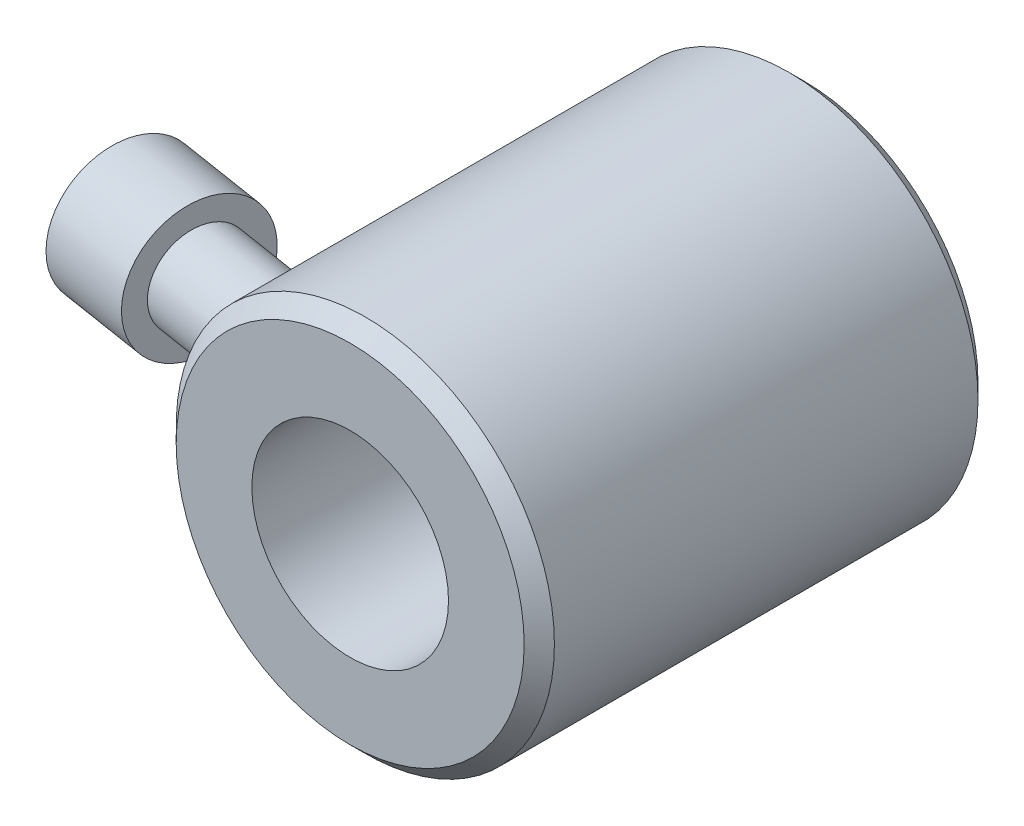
ISO-10303-21;
HEADER;
FILE_DESCRIPTION(('STEP AP214'),'2;1');
FILE_NAME('part.step','',(''),(''),'','','');
FILE_SCHEMA(('AUTOMOTIVE_DESIGN { 1 0 10303 214 1 1 1 1 }'));
ENDSEC;
DATA;
#1=APPLICATION_CONTEXT('core data for automotive mechanical design processes');
#2=APPLICATION_PROTOCOL_DEFINITION('international standard','automotive_design',2000,#1);
#3=PRODUCT_CONTEXT('',#1,'mechanical');
#4=PRODUCT('Part','Part','',(#3));
#5=PRODUCT_RELATED_PRODUCT_CATEGORY('part','',(#4));
#6=PRODUCT_DEFINITION_FORMATION('','',#4);
#7=PRODUCT_DEFINITION_CONTEXT('part definition',#1,'design');
#8=PRODUCT_DEFINITION('design','',#6,#7);
#9=PRODUCT_DEFINITION_SHAPE('','',#8);
#10=(LENGTH_UNIT() NAMED_UNIT(*) SI_UNIT(.MILLI.,.METRE.));
#11=(NAMED_UNIT(*) PLANE_ANGLE_UNIT() SI_UNIT($,.RADIAN.));
#12=(NAMED_UNIT(*) SI_UNIT($,.STERADIAN.) SOLID_ANGLE_UNIT());
#13=UNCERTAINTY_MEASURE_WITH_UNIT(LENGTH_MEASURE(1.E-05),#10,'distance_accuracy_value','');
#14=(GEOMETRIC_REPRESENTATION_CONTEXT(3) GLOBAL_UNCERTAINTY_ASSIGNED_CONTEXT((#13)) GLOBAL_UNIT_ASSIGNED_CONTEXT((#10,
#11,#12)) REPRESENTATION_CONTEXT('',''));
#15=CARTESIAN_POINT('',(0.,0.,0.));
#16=DIRECTION('',(0.,0.,1.));
#17=DIRECTION('',(1.,0.,0.));
#18=AXIS2_PLACEMENT_3D('',#15,#16,#17);
#19=CARTESIAN_POINT('',(0.,0.,60.));
#20=DIRECTION('',(0.,0.,1.));
#21=DIRECTION('',(1.,0.,0.));
#22=AXIS2_PLACEMENT_3D('',#19,#20,#21);
#23=PLANE('',#22);
#24=CARTESIAN_POINT('',(0.,0.,60.));
#25=DIRECTION('',(0.,0.,1.));
#26=DIRECTION('',(1.,0.,0.));
#27=AXIS2_PLACEMENT_3D('',#24,#25,#26);
#28=CIRCLE('',#27,13.);
#29=CARTESIAN_POINT('',(13.,0.,60.));
#30=VERTEX_POINT('',#29);
#31=EDGE_CURVE('E170',#30,#30,#28,.T.);
#32=ORIENTED_EDGE('',*,*,#31,.F.);
#33=EDGE_LOOP('',(#32));
#34=FACE_BOUND('',#33,.T.);
#35=CARTESIAN_POINT('',(0.,0.,60.));
#36=DIRECTION('',(0.,0.,1.));
#37=DIRECTION('',(1.,0.,0.));
#38=AXIS2_PLACEMENT_3D('',#35,#36,#37);
#39=CIRCLE('',#38,23.);
#40=CARTESIAN_POINT('',(23.,0.,60.));
#41=VERTEX_POINT('',#40);
#42=EDGE_CURVE('E435',#41,#41,#39,.F.);
#43=ORIENTED_EDGE('',*,*,#42,.F.);
#44=EDGE_LOOP('',(#43));
#45=FACE_BOUND('',#44,.T.);
#46=ADVANCED_FACE('F15',(#34,#45),#23,.T.);
#47=CARTESIAN_POINT('',(-40.37492091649,8.75,39.5648517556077));
#48=DIRECTION('',(-0.987688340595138,0.,-0.156434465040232));
#49=DIRECTION('',(-0.156434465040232,0.,0.987688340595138));
#50=AXIS2_PLACEMENT_3D('',#47,#48,#49);
#51=PLANE('',#50);
#52=CARTESIAN_POINT('',(-40.37492091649,0.,39.5648517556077));
#53=DIRECTION('',(-0.987688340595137,0.,-0.156434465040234));
#54=DIRECTION('',(-0.156434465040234,0.,0.987688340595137));
#55=AXIS2_PLACEMENT_3D('',#52,#53,#54);
#56=CIRCLE('',#55,6.);
#57=CARTESIAN_POINT('',(-41.3135277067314,0.,45.4909817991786));
#58=VERTEX_POINT('',#57);
#59=EDGE_CURVE('E143',#58,#58,#56,.T.);
#60=ORIENTED_EDGE('',*,*,#59,.T.);
#61=EDGE_LOOP('',(#60));
#62=FACE_BOUND('',#61,.T.);
#63=CARTESIAN_POINT('',(-40.37492091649,0.,39.5648517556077));
#64=DIRECTION('',(-0.987688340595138,0.,-0.156434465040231));
#65=DIRECTION('',(-0.156434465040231,0.,0.987688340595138));
#66=AXIS2_PLACEMENT_3D('',#63,#64,#65);
#67=CIRCLE('',#66,9.);
#68=CARTESIAN_POINT('',(-41.7828311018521,0.,48.4540468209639));
#69=VERTEX_POINT('',#68);
#70=EDGE_CURVE('E432',#69,#69,#67,.T.);
#71=ORIENTED_EDGE('',*,*,#70,.F.);
#72=EDGE_LOOP('',(#71));
#73=FACE_BOUND('',#72,.T.);
#74=ADVANCED_FACE('F205',(#62,#73),#51,.F.);
#75=CARTESIAN_POINT('',(13.,0.,8.));
#76=DIRECTION('',(0.,0.,-1.));
#77=DIRECTION('',(-1.,0.,0.));
#78=AXIS2_PLACEMENT_3D('',#75,#76,#77);
#79=PLANE('',#78);
#80=CARTESIAN_POINT('',(0.,0.,8.));
#81=DIRECTION('',(0.,0.,1.));
#82=DIRECTION('',(1.,0.,0.));
#83=AXIS2_PLACEMENT_3D('',#80,#81,#82);
#84=CIRCLE('',#83,6.5);
#85=CARTESIAN_POINT('',(6.5,0.,8.));
#86=VERTEX_POINT('',#85);
#87=EDGE_CURVE('E176',#86,#86,#84,.T.);
#88=ORIENTED_EDGE('',*,*,#87,.F.);
#89=EDGE_LOOP('',(#88));
#90=FACE_BOUND('',#89,.T.);
#91=CARTESIAN_POINT('',(0.,0.,8.));
#92=DIRECTION('',(0.,0.,1.));
#93=DIRECTION('',(1.,0.,0.));
#94=AXIS2_PLACEMENT_3D('',#91,#92,#93);
#95=CIRCLE('',#94,13.);
#96=CARTESIAN_POINT('',(13.,0.,8.));
#97=VERTEX_POINT('',#96);
#98=EDGE_CURVE('E173',#97,#97,#95,.T.);
#99=ORIENTED_EDGE('',*,*,#98,.T.);
#100=EDGE_LOOP('',(#99));
#101=FACE_BOUND('',#100,.T.);
#102=ADVANCED_FACE('F202',(#90,#101),#79,.F.);
#103=CARTESIAN_POINT('',(0.,0.,0.));
#104=DIRECTION('',(0.,0.,-1.));
#105=DIRECTION('',(-1.,0.,0.));
#106=AXIS2_PLACEMENT_3D('',#103,#104,#105);
#107=CYLINDRICAL_SURFACE('',#106,24.);
#108=DIRECTION('',(0.,0.,-1.));
#109=VECTOR('',#108,1.);
#110=CARTESIAN_POINT('',(-1.25,-23.9674258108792,0.));
#111=LINE('',#110,#109);
#112=CARTESIAN_POINT('',(-1.25,-23.9674258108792,40.721687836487));
#113=VERTEX_POINT('',#112);
#114=CARTESIAN_POINT('',(-1.25,-23.9674258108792,39.278312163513));
#115=VERTEX_POINT('',#114);
#116=EDGE_CURVE('E423',#113,#115,#111,.T.);
#117=ORIENTED_EDGE('',*,*,#116,.T.);
#118=CARTESIAN_POINT('',(0.,0.,38.556624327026));
#119=DIRECTION('',(-0.5,0.,-0.866025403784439));
#120=DIRECTION('',(0.866025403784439,0.,-0.5));
#121=AXIS2_PLACEMENT_3D('',#118,#119,#120);
#122=ELLIPSE('',#121,27.7128129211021,24.);
#123=CARTESIAN_POINT('',(0.,-24.,38.556624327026));
#124=VERTEX_POINT('',#123);
#125=EDGE_CURVE('E148',#115,#124,#122,.F.);
#126=ORIENTED_EDGE('',*,*,#125,.T.);
#127=CARTESIAN_POINT('',(0.,0.,38.556624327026));
#128=DIRECTION('',(0.5,0.,-0.866025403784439));
#129=DIRECTION('',(-0.866025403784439,0.,-0.5));
#130=AXIS2_PLACEMENT_3D('',#127,#128,#129);
#131=ELLIPSE('',#130,27.7128129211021,24.);
#132=CARTESIAN_POINT('',(1.25,-23.9674258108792,39.278312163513));
#133=VERTEX_POINT('',#132);
#134=EDGE_CURVE('E24',#124,#133,#131,.F.);
#135=ORIENTED_EDGE('',*,*,#134,.T.);
#136=DIRECTION('',(0.,0.,-1.));
#137=VECTOR('',#136,1.);
#138=CARTESIAN_POINT('',(1.25,-23.9674258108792,0.));
#139=LINE('',#138,#137);
#140=CARTESIAN_POINT('',(1.25,-23.9674258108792,40.721687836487));
#141=VERTEX_POINT('',#140);
#142=EDGE_CURVE('E138',#133,#141,#139,.F.);
#143=ORIENTED_EDGE('',*,*,#142,.T.);
#144=CARTESIAN_POINT('',(0.,0.,41.4433756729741));
#145=DIRECTION('',(0.5,0.,0.866025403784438));
#146=DIRECTION('',(0.866025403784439,0.,-0.5));
#147=AXIS2_PLACEMENT_3D('',#144,#145,#146);
#148=ELLIPSE('',#147,27.7128129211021,24.);
#149=CARTESIAN_POINT('',(0.,-24.,41.443375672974));
#150=VERTEX_POINT('',#149);
#151=EDGE_CURVE('E142',#141,#150,#148,.F.);
#152=ORIENTED_EDGE('',*,*,#151,.T.);
#153=CARTESIAN_POINT('',(0.,0.,41.443375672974));
#154=DIRECTION('',(-0.5,0.,0.866025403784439));
#155=DIRECTION('',(-0.866025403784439,0.,-0.5));
#156=AXIS2_PLACEMENT_3D('',#153,#154,#155);
#157=ELLIPSE('',#156,27.7128129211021,24.);
#158=EDGE_CURVE('E421',#150,#113,#157,.F.);
#159=ORIENTED_EDGE('',*,*,#158,.T.);
#160=EDGE_LOOP('',(#117,#126,#135,#143,#152,#159));
#161=FACE_BOUND('',#160,.T.);
#162=ADVANCED_FACE('F147',(#161),#107,.T.);
#163=CARTESIAN_POINT('',(0.,0.,0.));
#164=DIRECTION('',(0.,0.,1.));
#165=DIRECTION('',(1.,0.,0.));
#166=AXIS2_PLACEMENT_3D('',#163,#164,#165);
#167=CYLINDRICAL_SURFACE('',#166,13.);
#168=ORIENTED_EDGE('',*,*,#31,.T.);
#169=EDGE_LOOP('',(#168));
#170=FACE_BOUND('',#169,.T.);
#171=ORIENTED_EDGE('',*,*,#98,.F.);
#172=EDGE_LOOP('',(#171));
#173=FACE_BOUND('',#172,.T.);
#174=ADVANCED_FACE('F207',(#170,#173),#167,.F.);
#175=CARTESIAN_POINT('',(0.,0.,0.));
#176=DIRECTION('',(0.,0.,1.));
#177=DIRECTION('',(1.,0.,0.));
#178=AXIS2_PLACEMENT_3D('',#175,#176,#177);
#179=CYLINDRICAL_SURFACE('',#178,6.5);
#180=CARTESIAN_POINT('',(0.,0.,1.));
#181=DIRECTION('',(0.,0.,-1.));
#182=DIRECTION('',(-1.,0.,0.));
#183=AXIS2_PLACEMENT_3D('',#180,#181,#182);
#184=CIRCLE('',#183,6.5);
#185=CARTESIAN_POINT('',(-6.5,0.,1.));
#186=VERTEX_POINT('',#185);
#187=EDGE_CURVE('E151',#186,#186,#184,.T.);
#188=ORIENTED_EDGE('',*,*,#187,.T.);
#189=EDGE_LOOP('',(#188));
#190=FACE_BOUND('',#189,.T.);
#191=ORIENTED_EDGE('',*,*,#87,.T.);
#192=EDGE_LOOP('',(#191));
#193=FACE_BOUND('',#192,.T.);
#194=ADVANCED_FACE('F210',(#190,#193),#179,.F.);
#195=CARTESIAN_POINT('',(1.25,-21.,39.278312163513));
#196=DIRECTION('',(1.,0.,0.));
#197=DIRECTION('',(0.,-1.,0.));
#198=AXIS2_PLACEMENT_3D('',#195,#196,#197);
#199=PLANE('',#198);
#200=ORIENTED_EDGE('',*,*,#142,.F.);
#201=DIRECTION('',(0.,-1.,0.));
#202=VECTOR('',#201,1.);
#203=CARTESIAN_POINT('',(1.25,-21.,39.278312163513));
#204=LINE('',#203,#202);
#205=CARTESIAN_POINT('',(1.25,-24.,39.278312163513));
#206=VERTEX_POINT('',#205);
#207=EDGE_CURVE('E123',#133,#206,#204,.T.);
#208=ORIENTED_EDGE('',*,*,#207,.T.);
#209=DIRECTION('',(0.,0.,1.));
#210=VECTOR('',#209,1.);
#211=CARTESIAN_POINT('',(1.25,-24.,39.278312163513));
#212=LINE('',#211,#210);
#213=CARTESIAN_POINT('',(1.25,-24.,40.721687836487));
#214=VERTEX_POINT('',#213);
#215=EDGE_CURVE('E405',#206,#214,#212,.T.);
#216=ORIENTED_EDGE('',*,*,#215,.T.);
#217=DIRECTION('',(0.,-1.,0.));
#218=VECTOR('',#217,1.);
#219=CARTESIAN_POINT('',(1.25,-21.,40.721687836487));
#220=LINE('',#219,#218);
#221=EDGE_CURVE('E133',#141,#214,#220,.T.);
#222=ORIENTED_EDGE('',*,*,#221,.F.);
#223=EDGE_LOOP('',(#200,#208,#216,#222));
#224=FACE_BOUND('',#223,.T.);
#225=ADVANCED_FACE('F139',(#224),#199,.F.);
#226=CARTESIAN_POINT('',(1.25,-21.,40.721687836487));
#227=DIRECTION('',(0.5,0.,0.866025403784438));
#228=DIRECTION('',(-0.866025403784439,0.,0.5));
#229=AXIS2_PLACEMENT_3D('',#226,#227,#228);
#230=PLANE('',#229);
#231=ORIENTED_EDGE('',*,*,#151,.F.);
#232=ORIENTED_EDGE('',*,*,#221,.T.);
#233=DIRECTION('',(-0.866025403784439,0.,0.5));
#234=VECTOR('',#233,1.);
#235=CARTESIAN_POINT('',(1.25,-24.,40.721687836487));
#236=LINE('',#235,#234);
#237=EDGE_CURVE('E407',#214,#150,#236,.T.);
#238=ORIENTED_EDGE('',*,*,#237,.T.);
#239=EDGE_LOOP('',(#231,#232,#238));
#240=FACE_BOUND('',#239,.T.);
#241=ADVANCED_FACE('F273',(#240),#230,.F.);
#242=CARTESIAN_POINT('',(0.,-21.,41.443375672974));
#243=DIRECTION('',(-0.5,0.,0.866025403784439));
#244=DIRECTION('',(-0.866025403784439,0.,-0.5));
#245=AXIS2_PLACEMENT_3D('',#242,#243,#244);
#246=PLANE('',#245);
#247=ORIENTED_EDGE('',*,*,#158,.F.);
#248=DIRECTION('',(-0.866025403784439,0.,-0.5));
#249=VECTOR('',#248,1.);
#250=CARTESIAN_POINT('',(0.,-24.,41.443375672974));
#251=LINE('',#250,#249);
#252=CARTESIAN_POINT('',(-1.25,-24.,40.721687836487));
#253=VERTEX_POINT('',#252);
#254=EDGE_CURVE('E410',#150,#253,#251,.T.);
#255=ORIENTED_EDGE('',*,*,#254,.T.);
#256=DIRECTION('',(0.,-1.,0.));
#257=VECTOR('',#256,1.);
#258=CARTESIAN_POINT('',(-1.25,-21.,40.721687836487));
#259=LINE('',#258,#257);
#260=EDGE_CURVE('E253',#113,#253,#259,.T.);
#261=ORIENTED_EDGE('',*,*,#260,.F.);
#262=EDGE_LOOP('',(#247,#255,#261));
#263=FACE_BOUND('',#262,.T.);
#264=ADVANCED_FACE('F276',(#263),#246,.F.);
#265=CARTESIAN_POINT('',(-1.25,-21.,40.721687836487));
#266=DIRECTION('',(-1.,0.,0.));
#267=DIRECTION('',(0.,1.,0.));
#268=AXIS2_PLACEMENT_3D('',#265,#266,#267);
#269=PLANE('',#268);
#270=ORIENTED_EDGE('',*,*,#116,.F.);
#271=ORIENTED_EDGE('',*,*,#260,.T.);
#272=DIRECTION('',(0.,0.,-1.));
#273=VECTOR('',#272,1.);
#274=CARTESIAN_POINT('',(-1.25,-24.,40.721687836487));
#275=LINE('',#274,#273);
#276=CARTESIAN_POINT('',(-1.25,-24.,39.278312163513));
#277=VERTEX_POINT('',#276);
#278=EDGE_CURVE('E134',#253,#277,#275,.T.);
#279=ORIENTED_EDGE('',*,*,#278,.T.);
#280=DIRECTION('',(0.,-1.,0.));
#281=VECTOR('',#280,1.);
#282=CARTESIAN_POINT('',(-1.25,-21.,39.278312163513));
#283=LINE('',#282,#281);
#284=EDGE_CURVE('E252',#115,#277,#283,.T.);
#285=ORIENTED_EDGE('',*,*,#284,.F.);
#286=EDGE_LOOP('',(#270,#271,#279,#285));
#287=FACE_BOUND('',#286,.T.);
#288=ADVANCED_FACE('F267',(#287),#269,.F.);
#289=CARTESIAN_POINT('',(-1.25,-21.,39.278312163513));
#290=DIRECTION('',(-0.5,0.,-0.866025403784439));
#291=DIRECTION('',(0.866025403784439,0.,-0.5));
#292=AXIS2_PLACEMENT_3D('',#289,#290,#291);
#293=PLANE('',#292);
#294=ORIENTED_EDGE('',*,*,#125,.F.);
#295=ORIENTED_EDGE('',*,*,#284,.T.);
#296=DIRECTION('',(0.866025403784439,0.,-0.5));
#297=VECTOR('',#296,1.);
#298=CARTESIAN_POINT('',(-1.25,-24.,39.278312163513));
#299=LINE('',#298,#297);
#300=EDGE_CURVE('E401',#277,#124,#299,.T.);
#301=ORIENTED_EDGE('',*,*,#300,.T.);
#302=EDGE_LOOP('',(#294,#295,#301));
#303=FACE_BOUND('',#302,.T.);
#304=ADVANCED_FACE('F264',(#303),#293,.F.);
#305=CARTESIAN_POINT('',(0.,-21.,38.556624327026));
#306=DIRECTION('',(0.5,0.,-0.866025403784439));
#307=DIRECTION('',(0.866025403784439,0.,0.5));
#308=AXIS2_PLACEMENT_3D('',#305,#306,#307);
#309=PLANE('',#308);
#310=ORIENTED_EDGE('',*,*,#134,.F.);
#311=DIRECTION('',(0.866025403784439,0.,0.5));
#312=VECTOR('',#311,1.);
#313=CARTESIAN_POINT('',(0.,-24.,38.556624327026));
#314=LINE('',#313,#312);
#315=EDGE_CURVE('E129',#124,#206,#314,.T.);
#316=ORIENTED_EDGE('',*,*,#315,.T.);
#317=ORIENTED_EDGE('',*,*,#207,.F.);
#318=EDGE_LOOP('',(#310,#316,#317));
#319=FACE_BOUND('',#318,.T.);
#320=ADVANCED_FACE('F125',(#319),#309,.F.);
#321=CARTESIAN_POINT('',(0.,0.,0.));
#322=DIRECTION('',(0.,0.,-1.));
#323=DIRECTION('',(-1.,0.,0.));
#324=AXIS2_PLACEMENT_3D('',#321,#322,#323);
#325=CONICAL_SURFACE('',#324,7.5,0.785398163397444);
#326=ORIENTED_EDGE('',*,*,#187,.F.);
#327=EDGE_LOOP('',(#326));
#328=FACE_BOUND('',#327,.T.);
#329=CARTESIAN_POINT('',(0.,0.,0.));
#330=DIRECTION('',(0.,0.,-1.));
#331=DIRECTION('',(-1.,0.,0.));
#332=AXIS2_PLACEMENT_3D('',#329,#330,#331);
#333=CIRCLE('',#332,7.5);
#334=CARTESIAN_POINT('',(-7.5,0.,0.));
#335=VERTEX_POINT('',#334);
#336=EDGE_CURVE('E154',#335,#335,#333,.F.);
#337=ORIENTED_EDGE('',*,*,#336,.F.);
#338=EDGE_LOOP('',(#337));
#339=FACE_BOUND('',#338,.T.);
#340=ADVANCED_FACE('F17',(#328,#339),#325,.F.);
#341=CARTESIAN_POINT('',(0.,-24.,40.));
#342=DIRECTION('',(0.,-1.,0.));
#343=DIRECTION('',(-1.,0.,0.));
#344=AXIS2_PLACEMENT_3D('',#341,#342,#343);
#345=PLANE('',#344);
#346=ORIENTED_EDGE('',*,*,#315,.F.);
#347=ORIENTED_EDGE('',*,*,#300,.F.);
#348=ORIENTED_EDGE('',*,*,#278,.F.);
#349=ORIENTED_EDGE('',*,*,#254,.F.);
#350=ORIENTED_EDGE('',*,*,#237,.F.);
#351=ORIENTED_EDGE('',*,*,#215,.F.);
#352=EDGE_LOOP('',(#346,#347,#348,#349,#350,#351));
#353=FACE_BOUND('',#352,.T.);
#354=CARTESIAN_POINT('',(0.,-24.,40.));
#355=DIRECTION('',(0.,-1.,0.));
#356=DIRECTION('',(0.,0.,-1.));
#357=AXIS2_PLACEMENT_3D('',#354,#355,#356);
#358=CIRCLE('',#357,2.5);
#359=CARTESIAN_POINT('',(0.,-24.,42.5));
#360=VERTEX_POINT('',#359);
#361=CARTESIAN_POINT('',(0.,-24.,37.5));
#362=VERTEX_POINT('',#361);
#363=EDGE_CURVE('E31',#360,#362,#358,.T.);
#364=ORIENTED_EDGE('',*,*,#363,.T.);
#365=CARTESIAN_POINT('',(0.,-24.,40.));
#366=DIRECTION('',(0.,-1.,0.));
#367=DIRECTION('',(0.,0.,-1.));
#368=AXIS2_PLACEMENT_3D('',#365,#366,#367);
#369=CIRCLE('',#368,2.5);
#370=EDGE_CURVE('E19',#362,#360,#369,.T.);
#371=ORIENTED_EDGE('',*,*,#370,.T.);
#372=EDGE_LOOP('',(#364,#371));
#373=FACE_BOUND('',#372,.T.);
#374=ADVANCED_FACE('F226',(#353,#373),#345,.T.);
#375=CARTESIAN_POINT('',(-24.,0.,16.4239658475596));
#376=CARTESIAN_POINT('',(-23.9999995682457,0.0698849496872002,16.4239627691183));
#377=CARTESIAN_POINT('',(-23.999691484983,0.139819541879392,16.4180606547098));
#378=CARTESIAN_POINT('',(-23.9984921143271,0.27775823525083,16.3946000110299));
#379=CARTESIAN_POINT('',(-23.9976001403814,0.345759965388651,16.3770277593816));
#380=CARTESIAN_POINT('',(-23.9953340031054,0.47781292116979,16.3307343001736));
#381=CARTESIAN_POINT('',(-23.9939600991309,0.54186624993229,16.3020190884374));
#382=CARTESIAN_POINT('',(-23.9908847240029,0.66422964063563,16.2342713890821));
#383=CARTESIAN_POINT('',(-23.9891833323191,0.72254109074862,16.1952414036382));
#384=CARTESIAN_POINT('',(-23.9856402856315,0.831903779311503,16.1079054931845));
#385=CARTESIAN_POINT('',(-23.9837983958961,0.882942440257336,16.0595838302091));
#386=CARTESIAN_POINT('',(-23.9801825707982,0.976232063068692,15.9550914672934));
#387=CARTESIAN_POINT('',(-23.9784086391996,1.01848253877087,15.8989203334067));
#388=CARTESIAN_POINT('',(-23.9751166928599,1.09324858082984,15.7800193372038));
#389=CARTESIAN_POINT('',(-23.9736000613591,1.12571221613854,15.7172567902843));
#390=CARTESIAN_POINT('',(-23.9710015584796,1.17975422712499,15.5872016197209));
#391=CARTESIAN_POINT('',(-23.9699197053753,1.20133214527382,15.5199088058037));
#392=CARTESIAN_POINT('',(-23.9683010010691,1.23321002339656,15.3820644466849));
#393=CARTESIAN_POINT('',(-23.9677690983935,1.24340764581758,15.3114891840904));
#394=CARTESIAN_POINT('',(-23.9673240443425,1.25195713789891,15.1696230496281));
#395=CARTESIAN_POINT('',(-23.9674109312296,1.25030827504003,15.0983321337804));
#396=CARTESIAN_POINT('',(-23.9681955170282,1.23517647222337,14.956272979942));
#397=CARTESIAN_POINT('',(-23.9688995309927,1.22157117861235,14.8855177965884));
#398=CARTESIAN_POINT('',(-23.9708460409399,1.18275710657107,14.7472702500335));
#399=CARTESIAN_POINT('',(-23.9720885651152,1.15754772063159,14.6797780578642));
#400=CARTESIAN_POINT('',(-23.9749795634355,1.09604005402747,14.5495979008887));
#401=CARTESIAN_POINT('',(-23.9766302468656,1.05968115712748,14.4869386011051));
#402=CARTESIAN_POINT('',(-23.9801453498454,0.976902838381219,14.3686627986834));
#403=CARTESIAN_POINT('',(-23.9820097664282,0.93048355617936,14.3130461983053));
#404=CARTESIAN_POINT('',(-23.985726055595,0.829152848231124,14.2108361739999));
#405=CARTESIAN_POINT('',(-23.9875779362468,0.774294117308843,14.1641905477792));
#406=CARTESIAN_POINT('',(-23.9910657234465,0.657401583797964,14.0809636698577));
#407=CARTESIAN_POINT('',(-23.9927016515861,0.59536849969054,14.0443814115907));
#408=CARTESIAN_POINT('',(-23.995539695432,0.467031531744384,13.9830102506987));
#409=CARTESIAN_POINT('',(-23.9967488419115,0.400820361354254,13.9580278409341));
#410=CARTESIAN_POINT('',(-23.9986317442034,0.265094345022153,13.9197557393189));
#411=CARTESIAN_POINT('',(-23.9993055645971,0.195579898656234,13.9064646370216));
#412=CARTESIAN_POINT('',(-24.0000321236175,0.0565769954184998,13.892154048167));
#413=CARTESIAN_POINT('',(-24.0000959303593,-0.012888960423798,13.8909158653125));
#414=CARTESIAN_POINT('',(-23.9996241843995,-0.151028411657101,13.9001811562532));
#415=CARTESIAN_POINT('',(-23.9990886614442,-0.219701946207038,13.9106840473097));
#416=CARTESIAN_POINT('',(-23.9974839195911,-0.353901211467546,13.942989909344));
#417=CARTESIAN_POINT('',(-23.9964178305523,-0.419442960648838,13.9647266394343));
#418=CARTESIAN_POINT('',(-23.9938720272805,-0.545999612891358,14.0187731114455));
#419=CARTESIAN_POINT('',(-23.9923922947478,-0.607014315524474,14.0510833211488));
#420=CARTESIAN_POINT('',(-23.9891636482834,-0.723508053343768,14.1256912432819));
#421=CARTESIAN_POINT('',(-23.9874120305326,-0.77892107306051,14.1680918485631));
#422=CARTESIAN_POINT('',(-23.9838430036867,-0.882009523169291,14.2614340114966));
#423=CARTESIAN_POINT('',(-23.9820255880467,-0.929684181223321,14.3123764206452));
#424=CARTESIAN_POINT('',(-23.9784870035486,-1.01691101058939,14.4224090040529));
#425=CARTESIAN_POINT('',(-23.9767683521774,-1.05628968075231,14.4816368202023));
#426=CARTESIAN_POINT('',(-23.9736559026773,-1.12472242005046,14.6057922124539));
#427=CARTESIAN_POINT('',(-23.9722621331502,-1.15377558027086,14.6707202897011));
#428=CARTESIAN_POINT('',(-23.9699359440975,-1.20114347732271,14.8054820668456));
#429=CARTESIAN_POINT('',(-23.9690107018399,-1.21929190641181,14.8753744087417));
#430=CARTESIAN_POINT('',(-23.9677592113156,-1.24365151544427,15.0172165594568));
#431=CARTESIAN_POINT('',(-23.9674329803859,-1.24986234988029,15.089166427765));
#432=CARTESIAN_POINT('',(-23.9674188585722,-1.25013348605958,15.2332969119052));
#433=CARTESIAN_POINT('',(-23.967732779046,-1.24415930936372,15.3054776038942));
#434=CARTESIAN_POINT('',(-23.9689695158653,-1.22009982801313,15.4477879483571));
#435=CARTESIAN_POINT('',(-23.9698923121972,-1.20201492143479,15.5179176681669));
#436=CARTESIAN_POINT('',(-23.9722338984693,-1.15436673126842,15.6535718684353));
#437=CARTESIAN_POINT('',(-23.9736489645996,-1.12488944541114,15.7191266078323));
#438=CARTESIAN_POINT('',(-23.976815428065,-1.05524003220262,15.8442734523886));
#439=CARTESIAN_POINT('',(-23.9785667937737,-1.015068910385,15.903866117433));
#440=CARTESIAN_POINT('',(-23.9821846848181,-0.925631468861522,16.0147341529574));
#441=CARTESIAN_POINT('',(-23.9840497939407,-0.876465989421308,16.0660909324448));
#442=CARTESIAN_POINT('',(-23.987699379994,-0.77013086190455,16.1597494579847));
#443=CARTESIAN_POINT('',(-23.9894838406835,-0.712959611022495,16.2020493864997));
#444=CARTESIAN_POINT('',(-23.992754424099,-0.592724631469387,16.2760525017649));
#445=CARTESIAN_POINT('',(-23.9942426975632,-0.529708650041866,16.3078332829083));
#446=CARTESIAN_POINT('',(-23.9967670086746,-0.399262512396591,16.3602848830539));
#447=CARTESIAN_POINT('',(-23.9978035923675,-0.33183779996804,16.3809691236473));
#448=CARTESIAN_POINT('',(-23.9990308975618,-0.219988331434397,16.4051716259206));
#449=CARTESIAN_POINT('',(-23.9993927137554,-0.176295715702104,16.4122104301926));
#450=CARTESIAN_POINT('',(-23.999877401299,-0.0884086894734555,16.4216085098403));
#451=CARTESIAN_POINT('',(-24.0000002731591,-0.0442142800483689,16.4239677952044));
#452=CARTESIAN_POINT('',(-24.,0.,16.4239658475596));
#453=B_SPLINE_CURVE_WITH_KNOTS('',3,(#375,#376,#377,#378,#379,#380,#381,#382,#383,#384,#385,
#386,#387,#388,#389,#390,#391,#392,#393,#394,#395,#396,#397,#398,#399,#400,#401,#402,#403,#404,
#405,#406,#407,#408,#409,#410,#411,#412,#413,#414,#415,#416,#417,#418,#419,#420,#421,#422,#423,
#424,#425,#426,#427,#428,#429,#430,#431,#432,#433,#434,#435,#436,#437,#438,#439,#440,#441,#442,
#443,#444,#445,#446,#447,#448,#449,#450,#451,#452),.UNSPECIFIED.,.T.,.F.,(4,2,2,2,2,2,2,2,2,2,2,
2,2,2,2,2,2,2,2,2,2,2,2,2,2,2,2,2,2,2,2,2,2,2,2,2,2,2,4),(0.,0.209493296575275,
0.419233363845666,0.628860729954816,0.838437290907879,1.04837200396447,1.2583183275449,
1.46935981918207,1.68041018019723,1.89334349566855,2.10628997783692,2.3214413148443,
2.53660391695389,2.75295767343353,2.96930842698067,3.1843593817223,3.39938881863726,
3.6106894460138,3.8219645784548,4.02939888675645,4.23682290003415,4.44303755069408,
4.64926132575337,4.85768561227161,5.06613068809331,5.27857737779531,5.49104276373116,
5.70667123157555,5.92230594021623,6.13855165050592,6.35479025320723,6.56942744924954,
6.78404447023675,6.99638833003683,7.20877476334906,7.41955767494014,7.63008506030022,
7.76262597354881,7.89516660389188),.UNSPECIFIED.);
#454=CARTESIAN_POINT('',(-24.,0.,16.4239658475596));
#455=VERTEX_POINT('',#454);
#456=EDGE_CURVE('E10',#455,#455,#453,.T.);
#457=ORIENTED_EDGE('',*,*,#456,.T.);
#458=EDGE_LOOP('',(#457));
#459=FACE_BOUND('',#458,.T.);
#460=ADVANCED_FACE('F219',(#459),#107,.T.);
#461=CARTESIAN_POINT('',(25.,0.,0.));
#462=DIRECTION('',(0.,0.,-1.));
#463=DIRECTION('',(-1.,0.,0.));
#464=AXIS2_PLACEMENT_3D('',#461,#462,#463);
#465=PLANE('',#464);
#466=ORIENTED_EDGE('',*,*,#336,.T.);
#467=EDGE_LOOP('',(#466));
#468=FACE_BOUND('',#467,.T.);
#469=CARTESIAN_POINT('',(0.,0.,0.));
#470=DIRECTION('',(0.,0.,-1.));
#471=DIRECTION('',(-1.,0.,0.));
#472=AXIS2_PLACEMENT_3D('',#469,#470,#471);
#473=CIRCLE('',#472,23.);
#474=CARTESIAN_POINT('',(-23.,0.,0.));
#475=VERTEX_POINT('',#474);
#476=EDGE_CURVE('E158',#475,#475,#473,.T.);
#477=ORIENTED_EDGE('',*,*,#476,.T.);
#478=EDGE_LOOP('',(#477));
#479=FACE_BOUND('',#478,.T.);
#480=ADVANCED_FACE('F216',(#468,#479),#465,.T.);
#481=CARTESIAN_POINT('',(0.,-10.,40.));
#482=DIRECTION('',(0.,-1.,0.));
#483=DIRECTION('',(0.,0.,-1.));
#484=AXIS2_PLACEMENT_3D('',#481,#482,#483);
#485=CYLINDRICAL_SURFACE('',#484,2.5);
#486=ORIENTED_EDGE('',*,*,#370,.F.);
#487=ORIENTED_EDGE('',*,*,#363,.F.);
#488=EDGE_LOOP('',(#486,#487));
#489=FACE_BOUND('',#488,.T.);
#490=CARTESIAN_POINT('',(0.,-25.,37.5));
#491=CARTESIAN_POINT('',(-0.140050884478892,-24.9999983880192,37.5000060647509));
#492=CARTESIAN_POINT('',(-0.280194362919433,-24.9988106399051,37.5118081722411));
#493=CARTESIAN_POINT('',(-0.556595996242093,-24.9941866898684,37.5587109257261));
#494=CARTESIAN_POINT('',(-0.69284969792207,-24.9907480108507,37.5938372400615));
#495=CARTESIAN_POINT('',(-0.957429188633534,-24.9820103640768,37.6863556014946));
#496=CARTESIAN_POINT('',(-1.08575971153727,-24.9767125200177,37.7437342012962));
#497=CARTESIAN_POINT('',(-1.33094040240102,-24.9648489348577,37.8791022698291));
#498=CARTESIAN_POINT('',(-1.4477928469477,-24.9582834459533,37.9570876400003));
#499=CARTESIAN_POINT('',(-1.66714887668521,-24.9445936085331,38.1317567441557));
#500=CARTESIAN_POINT('',(-1.76960536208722,-24.9374675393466,38.2284994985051));
#501=CARTESIAN_POINT('',(-1.95685630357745,-24.9234739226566,38.4378113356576));
#502=CARTESIAN_POINT('',(-2.04164994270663,-24.9166063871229,38.5503811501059));
#503=CARTESIAN_POINT('',(-2.19133492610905,-24.9038897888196,38.788446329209));
#504=CARTESIAN_POINT('',(-2.25618366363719,-24.8980429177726,38.9139686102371));
#505=CARTESIAN_POINT('',(-2.36386596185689,-24.8880509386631,39.1741889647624));
#506=CARTESIAN_POINT('',(-2.40670006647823,-24.8839057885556,39.3088868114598));
#507=CARTESIAN_POINT('',(-2.46899760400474,-24.8778021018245,39.583154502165));
#508=CARTESIAN_POINT('',(-2.48853913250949,-24.8758362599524,39.7227064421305));
#509=CARTESIAN_POINT('',(-2.5039382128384,-24.8742910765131,40.0031221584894));
#510=CARTESIAN_POINT('',(-2.49979638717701,-24.8747116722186,40.1439859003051));
#511=CARTESIAN_POINT('',(-2.4680107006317,-24.8778851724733,40.4224882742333));
#512=CARTESIAN_POINT('',(-2.44045211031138,-24.8806296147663,40.5601367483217));
#513=CARTESIAN_POINT('',(-2.36274786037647,-24.8881283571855,40.8288449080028));
#514=CARTESIAN_POINT('',(-2.31260189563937,-24.8928826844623,40.9599045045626));
#515=CARTESIAN_POINT('',(-2.19105223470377,-24.9038752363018,41.2119839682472));
#516=CARTESIAN_POINT('',(-2.11961070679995,-24.9101160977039,41.3329854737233));
#517=CARTESIAN_POINT('',(-1.95752506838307,-24.923376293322,41.5613130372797));
#518=CARTESIAN_POINT('',(-1.86688039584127,-24.9303956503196,41.6686386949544));
#519=CARTESIAN_POINT('',(-1.66848528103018,-24.9444596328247,41.8670634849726));
#520=CARTESIAN_POINT('',(-1.56066119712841,-24.9515042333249,41.958089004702));
#521=CARTESIAN_POINT('',(-1.33122370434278,-24.964795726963,42.120759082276));
#522=CARTESIAN_POINT('',(-1.209610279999,-24.9710426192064,42.1924036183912));
#523=CARTESIAN_POINT('',(-0.955995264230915,-24.9820368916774,42.3142750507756));
#524=CARTESIAN_POINT('',(-0.823991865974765,-24.9867840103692,42.3644982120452));
#525=CARTESIAN_POINT('',(-0.553368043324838,-24.9942411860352,42.4420472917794));
#526=CARTESIAN_POINT('',(-0.414747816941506,-24.9969513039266,42.4693738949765));
#527=CARTESIAN_POINT('',(-0.135462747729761,-25.0000212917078,42.5002607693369));
#528=CARTESIAN_POINT('',(0.00519075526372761,-25.0003912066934,42.5039226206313));
#529=CARTESIAN_POINT('',(0.285109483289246,-24.9987660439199,42.4876428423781));
#530=CARTESIAN_POINT('',(0.42437472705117,-24.9967709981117,42.4677015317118));
#531=CARTESIAN_POINT('',(0.697270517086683,-24.9906465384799,42.404865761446));
#532=CARTESIAN_POINT('',(0.830912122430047,-24.986521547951,42.362018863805));
#533=CARTESIAN_POINT('',(1.08911080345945,-24.9765999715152,42.2546370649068));
#534=CARTESIAN_POINT('',(1.21366767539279,-24.9708033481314,42.1901016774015));
#535=CARTESIAN_POINT('',(1.45062045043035,-24.9581618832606,42.0409229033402));
#536=CARTESIAN_POINT('',(1.56297414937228,-24.951313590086,41.9562127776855));
#537=CARTESIAN_POINT('',(1.77190405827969,-24.937348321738,41.7691848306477));
#538=CARTESIAN_POINT('',(1.86847987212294,-24.9302313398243,41.6668665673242));
#539=CARTESIAN_POINT('',(2.04346527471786,-24.9165006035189,41.4470835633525));
#540=CARTESIAN_POINT('',(2.12180819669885,-24.9098887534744,41.3295656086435));
#541=CARTESIAN_POINT('',(2.25764564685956,-24.8979458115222,41.0829815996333));
#542=CARTESIAN_POINT('',(2.3151404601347,-24.892614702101,40.953915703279));
#543=CARTESIAN_POINT('',(2.40753802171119,-24.8838486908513,40.6881281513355));
#544=CARTESIAN_POINT('',(2.44248043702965,-24.8804104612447,40.5514203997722));
#545=CARTESIAN_POINT('',(2.48891001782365,-24.8758091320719,40.2740420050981));
#546=CARTESIAN_POINT('',(2.50039785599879,-24.8746459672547,40.1333714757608));
#547=CARTESIAN_POINT('',(2.49958284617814,-24.8747278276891,39.8527232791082));
#548=CARTESIAN_POINT('',(2.48738472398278,-24.8759622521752,39.712745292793));
#549=CARTESIAN_POINT('',(2.43976363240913,-24.8806775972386,39.4368377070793));
#550=CARTESIAN_POINT('',(2.4043406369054,-24.884158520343,39.3009081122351));
#551=CARTESIAN_POINT('',(2.31130421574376,-24.8929717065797,39.0369566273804));
#552=CARTESIAN_POINT('',(2.25369386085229,-24.898303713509,38.9089336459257));
#553=CARTESIAN_POINT('',(2.11792888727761,-24.910218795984,38.6643577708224));
#554=CARTESIAN_POINT('',(2.03977438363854,-24.9168018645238,38.5478048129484));
#555=CARTESIAN_POINT('',(1.86474639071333,-24.9305121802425,38.3289408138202));
#556=CARTESIAN_POINT('',(1.76779487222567,-24.9376416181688,38.2266923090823));
#557=CARTESIAN_POINT('',(1.55807924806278,-24.9516213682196,38.0398694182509));
#558=CARTESIAN_POINT('',(1.44531136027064,-24.9584716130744,37.9552992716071));
#559=CARTESIAN_POINT('',(1.20685358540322,-24.9711390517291,37.8060663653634));
#560=CARTESIAN_POINT('',(1.0811318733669,-24.9769536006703,37.741454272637));
#561=CARTESIAN_POINT('',(0.820645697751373,-24.9868657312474,37.6343439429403));
#562=CARTESIAN_POINT('',(0.685891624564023,-24.9909652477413,37.5918207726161));
#563=CARTESIAN_POINT('',(0.458645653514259,-24.9959553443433,37.540698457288));
#564=CARTESIAN_POINT('',(0.367606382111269,-24.9974650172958,37.5254573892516));
#565=CARTESIAN_POINT('',(0.18439145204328,-24.9994878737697,37.5051061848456));
#566=CARTESIAN_POINT('',(0.0922157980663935,-25.0000010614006,37.4999960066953));
#567=CARTESIAN_POINT('',(0.,-25.,37.5));
#568=B_SPLINE_CURVE_WITH_KNOTS('',3,(#490,#491,#492,#493,#494,#495,#496,#497,#498,#499,#500,
#501,#502,#503,#504,#505,#506,#507,#508,#509,#510,#511,#512,#513,#514,#515,#516,#517,#518,#519,
#520,#521,#522,#523,#524,#525,#526,#527,#528,#529,#530,#531,#532,#533,#534,#535,#536,#537,#538,
#539,#540,#541,#542,#543,#544,#545,#546,#547,#548,#549,#550,#551,#552,#553,#554,#555,#556,#557,
#558,#559,#560,#561,#562,#563,#564,#565,#566,#567),.UNSPECIFIED.,.T.,.F.,(4,2,2,2,2,2,2,2,2,2,2,
2,2,2,2,2,2,2,2,2,2,2,2,2,2,2,2,2,2,2,2,2,2,2,2,2,2,2,4),(0.,0.419815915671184,
0.840094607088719,1.2601197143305,1.68006134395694,2.10134642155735,2.52265098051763,
2.94484938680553,3.36703736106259,3.78780580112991,4.20856318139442,4.62779493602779,
5.04703235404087,5.46701903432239,5.88701800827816,6.30886835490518,6.7307191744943,
7.15264351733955,7.574555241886,7.99465471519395,8.4147485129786,8.83397338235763,
9.25320765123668,9.67384851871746,10.0944999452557,10.516666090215,10.9388264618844,
11.3602422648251,11.7816459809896,12.2011907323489,12.620735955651,13.04022313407,
13.459707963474,13.8809729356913,14.302338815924,14.7247657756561,15.1467148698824,
15.4231416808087,15.6995673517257),.UNSPECIFIED.);
#569=CARTESIAN_POINT('',(0.,-25.,37.5));
#570=VERTEX_POINT('',#569);
#571=EDGE_CURVE('E250',#570,#570,#568,.T.);
#572=ORIENTED_EDGE('',*,*,#571,.F.);
#573=EDGE_LOOP('',(#572));
#574=FACE_BOUND('',#573,.T.);
#575=ADVANCED_FACE('F218',(#489,#574),#485,.F.);
#576=CARTESIAN_POINT('',(-37.2997519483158,0.,13.0519106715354));
#577=DIRECTION('',(-0.987688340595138,0.,-0.156434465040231));
#578=DIRECTION('',(-0.156434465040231,0.,0.987688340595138));
#579=AXIS2_PLACEMENT_3D('',#576,#577,#578);
#580=CYLINDRICAL_SURFACE('',#579,1.25);
#581=CARTESIAN_POINT('',(-25.,0.,16.265581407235));
#582=CARTESIAN_POINT('',(-24.9999995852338,0.0698742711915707,16.265578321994));
#583=CARTESIAN_POINT('',(-24.9997039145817,0.139798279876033,16.2596760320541));
#584=CARTESIAN_POINT('',(-24.9985528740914,0.277715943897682,16.236215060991));
#585=CARTESIAN_POINT('',(-24.9976968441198,0.345707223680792,16.2186426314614));
#586=CARTESIAN_POINT('',(-24.9955220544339,0.477739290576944,16.172350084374));
#587=CARTESIAN_POINT('',(-24.9942035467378,0.54178220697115,16.1436360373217));
#588=CARTESIAN_POINT('',(-24.9912521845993,0.664126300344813,16.0758932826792));
#589=CARTESIAN_POINT('',(-24.9896194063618,0.722428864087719,16.036867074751));
#590=CARTESIAN_POINT('',(-24.9862189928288,0.831783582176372,15.949537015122));
#591=CARTESIAN_POINT('',(-24.9844511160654,0.882822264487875,15.9012163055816));
#592=CARTESIAN_POINT('',(-24.9809804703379,0.976114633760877,15.7967279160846));
#593=CARTESIAN_POINT('',(-24.9792777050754,1.0183678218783,15.7405597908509));
#594=CARTESIAN_POINT('',(-24.9761172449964,1.09315188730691,15.6216526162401));
#595=CARTESIAN_POINT('',(-24.9746609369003,1.12562850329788,15.5588794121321));
#596=CARTESIAN_POINT('',(-24.9721656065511,1.17969538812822,15.4288018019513));
#597=CARTESIAN_POINT('',(-24.9711266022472,1.20128518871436,15.3614972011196));
#598=CARTESIAN_POINT('',(-24.969571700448,1.23318664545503,15.2236197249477));
#599=CARTESIAN_POINT('',(-24.9690606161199,1.24339459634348,15.1530228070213));
#600=CARTESIAN_POINT('',(-24.9686327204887,1.25195792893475,15.0111121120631));
#601=CARTESIAN_POINT('',(-24.9687159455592,1.25031258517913,14.9397982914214));
#602=CARTESIAN_POINT('',(-24.9694691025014,1.23518014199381,14.7977042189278));
#603=CARTESIAN_POINT('',(-24.9701450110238,1.22157240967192,14.7269368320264));
#604=CARTESIAN_POINT('',(-24.9720140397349,1.18274648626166,14.5886667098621));
#605=CARTESIAN_POINT('',(-24.973207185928,1.15752771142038,14.5211641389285));
#606=CARTESIAN_POINT('',(-24.9759829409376,1.09600410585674,14.3909888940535));
#607=CARTESIAN_POINT('',(-24.9775675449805,1.05964224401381,14.3283431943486));
#608=CARTESIAN_POINT('',(-24.9809418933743,0.976858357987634,14.210096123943));
#609=CARTESIAN_POINT('',(-24.9827316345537,0.930436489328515,14.1544946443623));
#610=CARTESIAN_POINT('',(-24.9862986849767,0.829111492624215,14.0523251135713));
#611=CARTESIAN_POINT('',(-24.9880760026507,0.774262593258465,14.0057033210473));
#612=CARTESIAN_POINT('',(-24.991423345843,0.657395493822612,13.9225198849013));
#613=CARTESIAN_POINT('',(-24.9929933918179,0.595378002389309,13.8859572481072));
#614=CARTESIAN_POINT('',(-24.995717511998,0.467064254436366,13.8246112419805));
#615=CARTESIAN_POINT('',(-24.9968782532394,0.400859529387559,13.7996367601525));
#616=CARTESIAN_POINT('',(-24.9986858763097,0.265149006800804,13.7613751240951));
#617=CARTESIAN_POINT('',(-24.9993328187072,0.195643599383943,13.7480865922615));
#618=CARTESIAN_POINT('',(-25.000030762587,0.0566320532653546,13.7337713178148));
#619=CARTESIAN_POINT('',(-25.0000921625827,-0.0128520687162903,13.7325306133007));
#620=CARTESIAN_POINT('',(-24.9996392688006,-0.15102834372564,13.7417932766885));
#621=CARTESIAN_POINT('',(-24.9991250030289,-0.219720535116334,13.7522960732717));
#622=CARTESIAN_POINT('',(-24.9975837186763,-0.353966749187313,13.7846075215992));
#623=CARTESIAN_POINT('',(-24.9965596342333,-0.419536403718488,13.8063515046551));
#624=CARTESIAN_POINT('',(-24.994114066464,-0.546146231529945,13.860420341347));
#625=CARTESIAN_POINT('',(-24.992692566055,-0.607186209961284,13.8927456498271));
#626=CARTESIAN_POINT('',(-24.9895914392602,-0.723710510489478,13.9673830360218));
#627=CARTESIAN_POINT('',(-24.9879092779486,-0.779130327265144,14.0097956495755));
#628=CARTESIAN_POINT('',(-24.9844820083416,-0.882227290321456,14.1031657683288));
#629=CARTESIAN_POINT('',(-24.9827368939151,-0.929903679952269,14.1541241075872));
#630=CARTESIAN_POINT('',(-24.9793400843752,-1.01711066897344,14.2641714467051));
#631=CARTESIAN_POINT('',(-24.9776907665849,-1.05647101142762,14.3233954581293));
#632=CARTESIAN_POINT('',(-24.9747042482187,-1.12486625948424,14.4475403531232));
#633=CARTESIAN_POINT('',(-24.9733670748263,-1.153900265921,14.5124617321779));
#634=CARTESIAN_POINT('',(-24.9711358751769,-1.20122718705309,14.6471989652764));
#635=CARTESIAN_POINT('',(-24.9702486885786,-1.21935505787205,14.7170729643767));
#636=CARTESIAN_POINT('',(-24.969049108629,-1.24367874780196,14.8588746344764));
#637=CARTESIAN_POINT('',(-24.9687367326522,-1.24987420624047,14.9308023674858));
#638=CARTESIAN_POINT('',(-24.968724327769,-1.25012236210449,15.0749034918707));
#639=CARTESIAN_POINT('',(-24.9690261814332,-1.24413772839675,15.1470769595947));
#640=CARTESIAN_POINT('',(-24.9702141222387,-1.22006151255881,15.2893723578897));
#641=CARTESIAN_POINT('',(-24.971100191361,-1.20197030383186,15.3594943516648));
#642=CARTESIAN_POINT('',(-24.9733485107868,-1.15430725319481,15.4951557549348));
#643=CARTESIAN_POINT('',(-24.9747073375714,-1.12481778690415,15.560724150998));
#644=CARTESIAN_POINT('',(-24.9777477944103,-1.05514237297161,15.6858971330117));
#645=CARTESIAN_POINT('',(-24.9794293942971,-1.01495742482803,15.7455022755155));
#646=CARTESIAN_POINT('',(-24.9829031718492,-0.925487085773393,15.8563976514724));
#647=CARTESIAN_POINT('',(-24.9846940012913,-0.876301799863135,15.9077687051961));
#648=CARTESIAN_POINT('',(-24.9881980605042,-0.76992387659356,16.0014506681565));
#649=CARTESIAN_POINT('',(-24.9899112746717,-0.712729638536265,16.0437597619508));
#650=CARTESIAN_POINT('',(-24.9930507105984,-0.592456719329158,16.1177672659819));
#651=CARTESIAN_POINT('',(-24.9944790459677,-0.529426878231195,16.1495450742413));
#652=CARTESIAN_POINT('',(-24.9969013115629,-0.398953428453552,16.2019848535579));
#653=CARTESIAN_POINT('',(-24.9978957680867,-0.33151528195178,16.2226602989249));
#654=CARTESIAN_POINT('',(-24.9990720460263,-0.21970683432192,16.2468294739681));
#655=CARTESIAN_POINT('',(-24.9994185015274,-0.176069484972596,16.2538524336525));
#656=CARTESIAN_POINT('',(-24.9998826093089,-0.0882947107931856,16.2632293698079));
#657=CARTESIAN_POINT('',(-25.0000002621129,-0.0441572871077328,16.2655833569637));
#658=CARTESIAN_POINT('',(-25.,0.,16.265581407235));
#659=B_SPLINE_CURVE_WITH_KNOTS('',3,(#581,#582,#583,#584,#585,#586,#587,#588,#589,#590,#591,
#592,#593,#594,#595,#596,#597,#598,#599,#600,#601,#602,#603,#604,#605,#606,#607,#608,#609,#610,
#611,#612,#613,#614,#615,#616,#617,#618,#619,#620,#621,#622,#623,#624,#625,#626,#627,#628,#629,
#630,#631,#632,#633,#634,#635,#636,#637,#638,#639,#640,#641,#642,#643,#644,#645,#646,#647,#648,
#649,#650,#651,#652,#653,#654,#655,#656,#657,#658),.UNSPECIFIED.,.T.,.F.,(4,2,2,2,2,2,2,2,2,2,2,
2,2,2,2,2,2,2,2,2,2,2,2,2,2,2,2,2,2,2,2,2,2,2,2,2,2,2,4),(0.,0.209461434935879,
0.419170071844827,0.628764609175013,0.838308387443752,1.04823587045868,1.25817526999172,
1.4692592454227,1.68035229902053,1.89335338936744,2.10636751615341,2.32155471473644,
2.53675273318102,2.75307108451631,2.96938609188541,3.18436328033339,3.39931923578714,
3.61059172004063,3.82183929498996,4.02932823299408,4.23680707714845,4.44310539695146,
4.6494125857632,4.85786912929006,5.06634602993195,5.27874786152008,5.49116818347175,
5.70672712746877,5.92229258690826,6.13851973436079,6.35474021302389,6.569426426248,
6.78409258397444,6.99650215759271,7.208954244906,7.41976609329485,7.63032150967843,
7.76269169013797,7.89506156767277),.UNSPECIFIED.);
#660=CARTESIAN_POINT('',(-25.,0.,16.265581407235));
#661=VERTEX_POINT('',#660);
#662=EDGE_CURVE('E187',#661,#661,#659,.T.);
#663=ORIENTED_EDGE('',*,*,#662,.T.);
#664=EDGE_LOOP('',(#663));
#665=FACE_BOUND('',#664,.T.);
#666=ORIENTED_EDGE('',*,*,#456,.F.);
#667=EDGE_LOOP('',(#666));
#668=FACE_BOUND('',#667,.T.);
#669=ADVANCED_FACE('F199',(#665,#668),#580,.F.);
#670=CARTESIAN_POINT('',(0.,0.,60.));
#671=DIRECTION('',(0.,0.,-1.));
#672=DIRECTION('',(-1.,0.,0.));
#673=AXIS2_PLACEMENT_3D('',#670,#671,#672);
#674=CONICAL_SURFACE('',#673,23.,0.785398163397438);
#675=CARTESIAN_POINT('',(0.,0.,58.));
#676=DIRECTION('',(0.,0.,1.));
#677=DIRECTION('',(1.,0.,0.));
#678=AXIS2_PLACEMENT_3D('',#675,#676,#677);
#679=CIRCLE('',#678,25.);
#680=CARTESIAN_POINT('',(25.,0.,58.));
#681=VERTEX_POINT('',#680);
#682=EDGE_CURVE('E167',#681,#681,#679,.F.);
#683=ORIENTED_EDGE('',*,*,#682,.F.);
#684=EDGE_LOOP('',(#683));
#685=FACE_BOUND('',#684,.T.);
#686=ORIENTED_EDGE('',*,*,#42,.T.);
#687=EDGE_LOOP('',(#686));
#688=FACE_BOUND('',#687,.T.);
#689=ADVANCED_FACE('F235',(#685,#688),#674,.T.);
#690=CARTESIAN_POINT('',(0.,0.,2.));
#691=DIRECTION('',(0.,0.,1.));
#692=DIRECTION('',(1.,0.,0.));
#693=AXIS2_PLACEMENT_3D('',#690,#691,#692);
#694=CONICAL_SURFACE('',#693,25.,0.785398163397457);
#695=ORIENTED_EDGE('',*,*,#476,.F.);
#696=EDGE_LOOP('',(#695));
#697=FACE_BOUND('',#696,.T.);
#698=CARTESIAN_POINT('',(0.,0.,2.));
#699=DIRECTION('',(0.,0.,-1.));
#700=DIRECTION('',(-1.,0.,0.));
#701=AXIS2_PLACEMENT_3D('',#698,#699,#700);
#702=CIRCLE('',#701,25.);
#703=CARTESIAN_POINT('',(-25.,0.,2.));
#704=VERTEX_POINT('',#703);
#705=EDGE_CURVE('E162',#704,#704,#702,.F.);
#706=ORIENTED_EDGE('',*,*,#705,.F.);
#707=EDGE_LOOP('',(#706));
#708=FACE_BOUND('',#707,.T.);
#709=ADVANCED_FACE('F232',(#697,#708),#694,.T.);
#710=CARTESIAN_POINT('',(0.,0.,0.));
#711=DIRECTION('',(0.,0.,1.));
#712=DIRECTION('',(1.,0.,0.));
#713=AXIS2_PLACEMENT_3D('',#710,#711,#712);
#714=CYLINDRICAL_SURFACE('',#713,25.);
#715=ORIENTED_EDGE('',*,*,#705,.T.);
#716=EDGE_LOOP('',(#715));
#717=FACE_BOUND('',#716,.T.);
#718=ORIENTED_EDGE('',*,*,#682,.T.);
#719=EDGE_LOOP('',(#718));
#720=FACE_BOUND('',#719,.T.);
#721=ORIENTED_EDGE('',*,*,#662,.F.);
#722=EDGE_LOOP('',(#721));
#723=FACE_BOUND('',#722,.T.);
#724=CARTESIAN_POINT('',(-25.,0.,48.074790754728));
#725=CARTESIAN_POINT('',(-25.000002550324,0.168460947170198,48.0747943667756));
#726=CARTESIAN_POINT('',(-24.998294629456,0.336872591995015,48.0678767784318));
#727=CARTESIAN_POINT('',(-24.9915151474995,0.672542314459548,48.0402582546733));
#728=CARTESIAN_POINT('',(-24.9864431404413,0.839800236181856,48.019555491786));
#729=CARTESIAN_POINT('',(-24.9730679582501,1.17197778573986,47.9644844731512));
#730=CARTESIAN_POINT('',(-24.9647635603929,1.33689650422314,47.9301110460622));
#731=CARTESIAN_POINT('',(-24.9451478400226,1.66322749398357,47.8479068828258));
#732=CARTESIAN_POINT('',(-24.9338354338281,1.82463847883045,47.8000712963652));
#733=CARTESIAN_POINT('',(-24.9085242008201,2.1426258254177,47.6912959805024));
#734=CARTESIAN_POINT('',(-24.8945274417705,2.299205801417,47.6303663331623));
#735=CARTESIAN_POINT('',(-24.8642196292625,2.60661624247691,47.4957433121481));
#736=CARTESIAN_POINT('',(-24.8479077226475,2.75744456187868,47.4220452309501));
#737=CARTESIAN_POINT('',(-24.8134298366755,3.05216401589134,47.2624026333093));
#738=CARTESIAN_POINT('',(-24.7952646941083,3.19605823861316,47.1764636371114));
#739=CARTESIAN_POINT('',(-24.7575691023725,3.47602260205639,46.9928227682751));
#740=CARTESIAN_POINT('',(-24.73803815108,3.61208983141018,46.89511655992));
#741=CARTESIAN_POINT('',(-24.6981286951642,3.87559389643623,46.6884202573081));
#742=CARTESIAN_POINT('',(-24.6777488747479,4.00301646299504,46.5794122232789));
#743=CARTESIAN_POINT('',(-24.6367383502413,4.24812586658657,46.3509035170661));
#744=CARTESIAN_POINT('',(-24.6161075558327,4.36580907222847,46.2313989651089));
#745=CARTESIAN_POINT('',(-24.5751993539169,4.59049176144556,45.9827694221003));
#746=CARTESIAN_POINT('',(-24.5549218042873,4.69749562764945,45.8536484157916));
#747=CARTESIAN_POINT('',(-24.5152881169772,4.90013419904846,45.5865632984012));
#748=CARTESIAN_POINT('',(-24.4959323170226,4.99576475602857,45.4485959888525));
#749=CARTESIAN_POINT('',(-24.4588705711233,5.17415533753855,45.166018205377));
#750=CARTESIAN_POINT('',(-24.4411520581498,5.25701735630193,45.0214737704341));
#751=CARTESIAN_POINT('',(-24.407691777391,5.4102435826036,44.7256847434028));
#752=CARTESIAN_POINT('',(-24.3919500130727,5.48060776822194,44.5744401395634));
#753=CARTESIAN_POINT('',(-24.3628980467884,5.60834126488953,44.2663585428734));
#754=CARTESIAN_POINT('',(-24.3495875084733,5.66571237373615,44.1095223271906));
#755=CARTESIAN_POINT('',(-24.3257740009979,5.76709926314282,43.7913808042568));
#756=CARTESIAN_POINT('',(-24.3152710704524,5.81111486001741,43.6300754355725));
#757=CARTESIAN_POINT('',(-24.2974946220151,5.88499611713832,43.306557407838));
#758=CARTESIAN_POINT('',(-24.2901763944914,5.91505809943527,43.1443919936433));
#759=CARTESIAN_POINT('',(-24.2787332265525,5.96185304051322,42.8179858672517));
#760=CARTESIAN_POINT('',(-24.2746093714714,5.97858146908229,42.6537444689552));
#761=CARTESIAN_POINT('',(-24.26965147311,5.99867777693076,42.3244443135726));
#762=CARTESIAN_POINT('',(-24.2688163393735,6.00205008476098,42.1593858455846));
#763=CARTESIAN_POINT('',(-24.2704187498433,5.99556038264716,41.829527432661));
#764=CARTESIAN_POINT('',(-24.2728575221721,5.98569340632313,41.6647276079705));
#765=CARTESIAN_POINT('',(-24.2850551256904,5.9361234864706,41.1690179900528));
#766=CARTESIAN_POINT('',(-24.2997414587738,5.87626032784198,40.8400135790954));
#767=CARTESIAN_POINT('',(-24.3403527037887,5.70567560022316,40.1963692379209));
#768=CARTESIAN_POINT('',(-24.3662802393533,5.59494215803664,39.8817326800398));
#769=CARTESIAN_POINT('',(-24.4277274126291,5.3204071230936,39.2616204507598));
#770=CARTESIAN_POINT('',(-24.4636020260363,5.15458472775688,38.9570742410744));
#771=CARTESIAN_POINT('',(-24.5403887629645,4.77561600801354,38.3794041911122));
#772=CARTESIAN_POINT('',(-24.5813021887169,4.56245743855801,38.1062885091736));
#773=CARTESIAN_POINT('',(-24.6436151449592,4.20799234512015,37.7225365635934));
#774=CARTESIAN_POINT('',(-24.6648467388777,4.0820334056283,37.5973836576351));
#775=CARTESIAN_POINT('',(-24.7068236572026,3.81974881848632,37.3584001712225));
#776=CARTESIAN_POINT('',(-24.727569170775,3.68342729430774,37.2445651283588));
#777=CARTESIAN_POINT('',(-24.7679654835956,3.40120743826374,37.0291535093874));
#778=CARTESIAN_POINT('',(-24.7876159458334,3.25530618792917,36.9275806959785));
#779=CARTESIAN_POINT('',(-24.8252091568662,2.95497442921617,36.7377207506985));
#780=CARTESIAN_POINT('',(-24.8431526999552,2.8005479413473,36.6494274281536));
#781=CARTESIAN_POINT('',(-24.8762519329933,2.48914277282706,36.4895288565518));
#782=CARTESIAN_POINT('',(-24.8914773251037,2.33239542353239,36.4174876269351));
#783=CARTESIAN_POINT('',(-24.9193380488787,2.01302420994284,36.2874608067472));
#784=CARTESIAN_POINT('',(-24.9319745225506,1.85040297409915,36.2294690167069));
#785=CARTESIAN_POINT('',(-24.9542673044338,1.52048362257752,36.1281707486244));
#786=CARTESIAN_POINT('',(-24.963924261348,1.35318653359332,36.0848610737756));
#787=CARTESIAN_POINT('',(-24.9799504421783,1.01522635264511,36.0134348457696));
#788=CARTESIAN_POINT('',(-24.9863198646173,0.844563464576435,35.9853173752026));
#789=CARTESIAN_POINT('',(-24.995256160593,0.512708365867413,35.945978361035));
#790=CARTESIAN_POINT('',(-24.9980474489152,0.351639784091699,35.9337588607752));
#791=CARTESIAN_POINT('',(-25.0005034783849,0.0290243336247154,35.9230036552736));
#792=CARTESIAN_POINT('',(-25.0001683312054,-0.132522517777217,35.9244674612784));
#793=CARTESIAN_POINT('',(-24.9963814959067,-0.454849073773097,35.9410606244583));
#794=CARTESIAN_POINT('',(-24.9929302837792,-0.615628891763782,35.9561878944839));
#795=CARTESIAN_POINT('',(-24.9830117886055,-0.935246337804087,35.9999347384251));
#796=CARTESIAN_POINT('',(-24.9765445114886,-1.09408396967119,36.0285542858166));
#797=CARTESIAN_POINT('',(-24.9609963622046,-1.40432152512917,36.0979996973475));
#798=CARTESIAN_POINT('',(-24.951992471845,-1.55580576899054,36.1384672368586));
#799=CARTESIAN_POINT('',(-24.9315425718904,-1.85490259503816,36.2314778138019));
#800=CARTESIAN_POINT('',(-24.9200957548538,-2.00251387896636,36.2840248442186));
#801=CARTESIAN_POINT('',(-24.8950603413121,-2.29285841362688,36.40068138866));
#802=CARTESIAN_POINT('',(-24.8814722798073,-2.43559287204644,36.46478801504));
#803=CARTESIAN_POINT('',(-24.8524884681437,-2.71544084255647,36.6040362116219));
#804=CARTESIAN_POINT('',(-24.8370920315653,-2.8525521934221,36.6791819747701));
#805=CARTESIAN_POINT('',(-24.8042455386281,-3.12554375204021,36.8430038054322));
#806=CARTESIAN_POINT('',(-24.7867390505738,-3.26117074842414,36.9320910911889));
#807=CARTESIAN_POINT('',(-24.7506313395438,-3.52476580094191,37.1207915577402));
#808=CARTESIAN_POINT('',(-24.7320297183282,-3.65273103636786,37.220408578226));
#809=CARTESIAN_POINT('',(-24.6752843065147,-4.024044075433,37.5339261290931));
#810=CARTESIAN_POINT('',(-24.6361769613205,-4.2549923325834,37.7626037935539));
#811=CARTESIAN_POINT('',(-24.5567451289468,-4.69244504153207,38.269061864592));
#812=CARTESIAN_POINT('',(-24.5165057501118,-4.8963990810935,38.5490627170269));
#813=CARTESIAN_POINT('',(-24.4605588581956,-5.16618584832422,38.9913540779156));
#814=CARTESIAN_POINT('',(-24.4426355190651,-5.25013152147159,39.1426002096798));
#815=CARTESIAN_POINT('',(-24.4087563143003,-5.40545461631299,39.451606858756));
#816=CARTESIAN_POINT('',(-24.3927997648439,-5.47683640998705,39.6093650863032));
#817=CARTESIAN_POINT('',(-24.3629030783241,-5.60835389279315,39.9349332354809));
#818=CARTESIAN_POINT('',(-24.3490328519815,-5.66811379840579,40.1029012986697));
#819=CARTESIAN_POINT('',(-24.3243158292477,-5.77326409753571,40.4434285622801));
#820=CARTESIAN_POINT('',(-24.3134678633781,-5.81866005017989,40.6159859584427));
#821=CARTESIAN_POINT('',(-24.2951546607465,-5.8946578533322,40.9645531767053));
#822=CARTESIAN_POINT('',(-24.2876902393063,-5.92525613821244,41.1405638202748));
#823=CARTESIAN_POINT('',(-24.2764243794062,-5.97124634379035,41.4946045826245));
#824=CARTESIAN_POINT('',(-24.2726213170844,-5.98664500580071,41.6726337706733));
#825=CARTESIAN_POINT('',(-24.2688911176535,-6.00174816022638,42.0241004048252));
#826=CARTESIAN_POINT('',(-24.2688522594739,-6.00190502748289,42.1975172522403));
#827=CARTESIAN_POINT('',(-24.2724069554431,-5.98751338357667,42.5436364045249));
#828=CARTESIAN_POINT('',(-24.2759990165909,-5.97297091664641,42.7163389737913));
#829=CARTESIAN_POINT('',(-24.2867339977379,-5.92917015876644,43.0597571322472));
#830=CARTESIAN_POINT('',(-24.2938768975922,-5.89991195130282,43.2304727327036));
#831=CARTESIAN_POINT('',(-24.311516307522,-5.82679907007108,43.5685714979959));
#832=CARTESIAN_POINT('',(-24.3220127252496,-5.78294479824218,43.7359547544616));
#833=CARTESIAN_POINT('',(-24.3455615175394,-5.68297087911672,44.0593826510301));
#834=CARTESIAN_POINT('',(-24.3584932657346,-5.62741941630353,44.2156120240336));
#835=CARTESIAN_POINT('',(-24.3868006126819,-5.50345317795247,44.5227161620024));
#836=CARTESIAN_POINT('',(-24.4021770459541,-5.43503400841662,44.6735890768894));
#837=CARTESIAN_POINT('',(-24.4349281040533,-5.28584098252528,44.9687909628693));
#838=CARTESIAN_POINT('',(-24.4523019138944,-5.20507216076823,45.1131225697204));
#839=CARTESIAN_POINT('',(-24.4885671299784,-5.03169184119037,45.3943620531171));
#840=CARTESIAN_POINT('',(-24.5074591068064,-4.93907588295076,45.5312671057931));
#841=CARTESIAN_POINT('',(-24.5461002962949,-4.74329522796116,45.7958403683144));
#842=CARTESIAN_POINT('',(-24.5658434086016,-4.6402001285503,45.9235609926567));
#843=CARTESIAN_POINT('',(-24.6057593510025,-4.42365567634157,46.169928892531));
#844=CARTESIAN_POINT('',(-24.6259323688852,-4.31020172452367,46.288572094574));
#845=CARTESIAN_POINT('',(-24.6661464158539,-4.0737692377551,46.5159660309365));
#846=CARTESIAN_POINT('',(-24.6861874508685,-3.9507911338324,46.6247172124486));
#847=CARTESIAN_POINT('',(-24.7255957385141,-3.69614825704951,46.8316597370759));
#848=CARTESIAN_POINT('',(-24.7449629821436,-3.5644833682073,46.9298509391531));
#849=CARTESIAN_POINT('',(-24.7827953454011,-3.29125578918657,47.1165105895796));
#850=CARTESIAN_POINT('',(-24.8012417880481,-3.14957115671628,47.2048043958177));
#851=CARTESIAN_POINT('',(-24.8363905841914,-2.85921012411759,47.3692971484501));
#852=CARTESIAN_POINT('',(-24.8530935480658,-2.7105361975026,47.4455003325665));
#853=CARTESIAN_POINT('',(-24.8843017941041,-2.40722744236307,47.5853503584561));
#854=CARTESIAN_POINT('',(-24.8988078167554,-2.25259464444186,47.6490014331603));
#855=CARTESIAN_POINT('',(-24.9252334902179,-1.93845627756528,47.7633657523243));
#856=CARTESIAN_POINT('',(-24.9371535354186,-1.77895145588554,47.8140809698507));
#857=CARTESIAN_POINT('',(-24.9646503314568,-1.35475644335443,47.9299473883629));
#858=CARTESIAN_POINT('',(-24.9778304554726,-1.08684843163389,47.9841981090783));
#859=CARTESIAN_POINT('',(-24.9955031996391,-0.545917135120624,48.0566167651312));
#860=CARTESIAN_POINT('',(-24.9999958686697,-0.272893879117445,48.0747849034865));
#861=CARTESIAN_POINT('',(-25.,0.,48.074790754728));
#862=B_SPLINE_CURVE_WITH_KNOTS('',3,(#724,#725,#726,#727,#728,#729,#730,#731,#732,#733,#734,
#735,#736,#737,#738,#739,#740,#741,#742,#743,#744,#745,#746,#747,#748,#749,#750,#751,#752,#753,
#754,#755,#756,#757,#758,#759,#760,#761,#762,#763,#764,#765,#766,#767,#768,#769,#770,#771,#772,
#773,#774,#775,#776,#777,#778,#779,#780,#781,#782,#783,#784,#785,#786,#787,#788,#789,#790,#791,
#792,#793,#794,#795,#796,#797,#798,#799,#800,#801,#802,#803,#804,#805,#806,#807,#808,#809,#810,
#811,#812,#813,#814,#815,#816,#817,#818,#819,#820,#821,#822,#823,#824,#825,#826,#827,#828,#829,
#830,#831,#832,#833,#834,#835,#836,#837,#838,#839,#840,#841,#842,#843,#844,#845,#846,#847,#848,
#849,#850,#851,#852,#853,#854,#855,#856,#857,#858,#859,#860,#861),.UNSPECIFIED.,.T.,.F.,(4,2,2,
2,2,2,2,2,2,2,2,2,2,2,2,2,2,2,2,2,2,2,2,2,2,2,2,2,2,2,2,2,2,2,2,2,2,2,2,2,2,2,2,2,2,2,2,2,2,2,2,
2,2,2,2,2,2,2,2,2,2,2,2,2,2,2,2,2,4),(0.,0.505147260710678,1.01036150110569,1.5157670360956,
2.02135489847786,2.52655485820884,3.03194147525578,3.53710089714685,4.04244702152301,
4.54860795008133,5.05495676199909,5.5610969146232,6.06742111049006,6.5694638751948,
7.07150752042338,7.57348165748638,8.07546269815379,8.57014932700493,9.06500395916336,
9.55969449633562,10.0545706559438,11.0538705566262,12.053403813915,13.0946270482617,
14.1361199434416,14.6720598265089,15.2077875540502,15.7436792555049,16.2793203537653,
16.7981889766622,17.3168282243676,17.8353544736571,18.3538494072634,18.8379148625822,
19.3219630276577,19.8059372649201,20.2899105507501,20.7605391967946,21.2313236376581,
21.7019906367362,22.1728368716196,22.6619134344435,23.15116895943,24.1290417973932,
25.1702213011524,25.6914575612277,26.2125120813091,26.748324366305,27.2839290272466,
27.8196626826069,28.3551586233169,28.8747560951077,29.394140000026,29.9135209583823,
30.4328876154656,30.9312361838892,31.4297552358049,31.9280715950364,32.4265761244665,
32.9219628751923,33.41757064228,33.9131559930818,34.4087479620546,34.912035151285,
35.4151455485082,35.91808599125,36.4209496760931,37.2392542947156,38.0575543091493),.UNSPECIFIED.);
#863=CARTESIAN_POINT('',(-25.,0.,48.074790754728));
#864=VERTEX_POINT('',#863);
#865=EDGE_CURVE('E179',#864,#864,#862,.T.);
#866=ORIENTED_EDGE('',*,*,#865,.F.);
#867=EDGE_LOOP('',(#866));
#868=FACE_BOUND('',#867,.T.);
#869=ORIENTED_EDGE('',*,*,#571,.T.);
#870=EDGE_LOOP('',(#869));
#871=FACE_BOUND('',#870,.T.);
#872=ADVANCED_FACE('F193',(#717,#720,#723,#868,#871),#714,.T.);
#873=CARTESIAN_POINT('',(-11.6331902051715,0.,44.1170946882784));
#874=DIRECTION('',(0.987688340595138,0.,0.156434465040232));
#875=DIRECTION('',(0.156434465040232,0.,-0.987688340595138));
#876=AXIS2_PLACEMENT_3D('',#873,#874,#875);
#877=CYLINDRICAL_SURFACE('',#876,6.);
#878=ORIENTED_EDGE('',*,*,#865,.T.);
#879=EDGE_LOOP('',(#878));
#880=FACE_BOUND('',#879,.T.);
#881=ORIENTED_EDGE('',*,*,#59,.F.);
#882=EDGE_LOOP('',(#881));
#883=FACE_BOUND('',#882,.T.);
#884=ADVANCED_FACE('F240',(#880,#883),#877,.T.);
#885=CARTESIAN_POINT('',(-44.3256742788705,0.,38.9391138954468));
#886=DIRECTION('',(-0.987688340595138,0.,-0.156434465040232));
#887=DIRECTION('',(-0.156434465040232,0.,0.987688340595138));
#888=AXIS2_PLACEMENT_3D('',#885,#886,#887);
#889=CONICAL_SURFACE('',#888,5.,1.0471975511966);
#890=CARTESIAN_POINT('',(-41.4744636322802,0.,39.3907012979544));
#891=VERTEX_POINT('',#890);
#892=VERTEX_LOOP('',#891);
#893=FACE_BOUND('',#892,.T.);
#894=CARTESIAN_POINT('',(-44.3256742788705,0.,38.9391138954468));
#895=DIRECTION('',(0.987688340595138,0.,0.156434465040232));
#896=DIRECTION('',(0.156434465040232,0.,-0.987688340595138));
#897=AXIS2_PLACEMENT_3D('',#894,#895,#896);
#898=CIRCLE('',#897,5.);
#899=CARTESIAN_POINT('',(-43.5435019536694,0.,34.0006721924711));
#900=VERTEX_POINT('',#899);
#901=CARTESIAN_POINT('',(-43.9345881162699,4.33012701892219,36.4698930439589));
#902=VERTEX_POINT('',#901);
#903=EDGE_CURVE('E339',#900,#902,#898,.T.);
#904=ORIENTED_EDGE('',*,*,#903,.F.);
#905=CARTESIAN_POINT('',(-44.3256742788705,0.,38.9391138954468));
#906=DIRECTION('',(0.987688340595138,0.,0.156434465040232));
#907=DIRECTION('',(0.156434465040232,0.,-0.987688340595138));
#908=AXIS2_PLACEMENT_3D('',#905,#906,#907);
#909=CIRCLE('',#908,5.);
#910=CARTESIAN_POINT('',(-43.9345881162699,-4.3301270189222,36.4698930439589));
#911=VERTEX_POINT('',#910);
#912=EDGE_CURVE('E399',#900,#911,#909,.F.);
#913=ORIENTED_EDGE('',*,*,#912,.T.);
#914=CARTESIAN_POINT('',(-44.7167604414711,-4.3301270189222,41.4083347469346));
#915=VERTEX_POINT('',#914);
#916=EDGE_CURVE('E402',#911,#915,#909,.F.);
#917=ORIENTED_EDGE('',*,*,#916,.T.);
#918=CARTESIAN_POINT('',(-45.1078466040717,0.,43.8775555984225));
#919=VERTEX_POINT('',#918);
#920=EDGE_CURVE('E691',#915,#919,#909,.F.);
#921=ORIENTED_EDGE('',*,*,#920,.T.);
#922=CARTESIAN_POINT('',(-44.7167604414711,4.33012701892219,41.4083347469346));
#923=VERTEX_POINT('',#922);
#924=EDGE_CURVE('E702',#919,#923,#909,.F.);
#925=ORIENTED_EDGE('',*,*,#924,.T.);
#926=EDGE_CURVE('E398',#923,#902,#909,.F.);
#927=ORIENTED_EDGE('',*,*,#926,.T.);
#928=EDGE_LOOP('',(#904,#913,#917,#921,#925,#927));
#929=FACE_BOUND('',#928,.T.);
#930=ADVANCED_FACE('F298',(#893,#929),#889,.F.);
#931=CARTESIAN_POINT('',(-44.3256742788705,0.,38.9391138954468));
#932=DIRECTION('',(0.987688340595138,0.,0.156434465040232));
#933=DIRECTION('',(0.156434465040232,0.,-0.987688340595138));
#934=AXIS2_PLACEMENT_3D('',#931,#932,#933);
#935=PLANE('',#934);
#936=ORIENTED_EDGE('',*,*,#926,.F.);
#937=DIRECTION('',(-0.135476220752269,-0.5,0.855363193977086));
#938=VECTOR('',#937,1.);
#939=CARTESIAN_POINT('',(-44.3256742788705,5.77350269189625,38.9391138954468));
#940=LINE('',#939,#938);
#941=CARTESIAN_POINT('',(-44.3256742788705,5.77350269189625,38.9391138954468));
#942=VERTEX_POINT('',#941);
#943=EDGE_CURVE('E364',#942,#923,#940,.T.);
#944=ORIENTED_EDGE('',*,*,#943,.F.);
#945=DIRECTION('',(-0.135476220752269,0.5,0.855363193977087));
#946=VECTOR('',#945,1.);
#947=CARTESIAN_POINT('',(-43.5435019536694,2.88675134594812,34.0006721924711));
#948=LINE('',#947,#946);
#949=EDGE_CURVE('E359',#902,#942,#948,.T.);
#950=ORIENTED_EDGE('',*,*,#949,.F.);
#951=EDGE_LOOP('',(#936,#944,#950));
#952=FACE_BOUND('',#951,.T.);
#953=ADVANCED_FACE('F328',(#952),#935,.F.);
#954=ORIENTED_EDGE('',*,*,#903,.T.);
#955=CARTESIAN_POINT('',(-43.5435019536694,2.88675134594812,34.0006721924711));
#956=VERTEX_POINT('',#955);
#957=EDGE_CURVE('E360',#956,#902,#948,.T.);
#958=ORIENTED_EDGE('',*,*,#957,.F.);
#959=DIRECTION('',(0.,1.,0.));
#960=VECTOR('',#959,1.);
#961=CARTESIAN_POINT('',(-43.5435019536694,-2.88675134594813,34.0006721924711));
#962=LINE('',#961,#960);
#963=EDGE_CURVE('E355',#900,#956,#962,.T.);
#964=ORIENTED_EDGE('',*,*,#963,.F.);
#965=EDGE_LOOP('',(#954,#958,#964));
#966=FACE_BOUND('',#965,.T.);
#967=ADVANCED_FACE('F324',(#966),#935,.F.);
#968=ORIENTED_EDGE('',*,*,#912,.F.);
#969=CARTESIAN_POINT('',(-43.5435019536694,-2.88675134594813,34.0006721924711));
#970=VERTEX_POINT('',#969);
#971=EDGE_CURVE('E356',#970,#900,#962,.T.);
#972=ORIENTED_EDGE('',*,*,#971,.F.);
#973=DIRECTION('',(0.135476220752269,0.5,-0.855363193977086));
#974=VECTOR('',#973,1.);
#975=CARTESIAN_POINT('',(-44.3256742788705,-5.77350269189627,38.9391138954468));
#976=LINE('',#975,#974);
#977=EDGE_CURVE('E351',#911,#970,#976,.T.);
#978=ORIENTED_EDGE('',*,*,#977,.F.);
#979=EDGE_LOOP('',(#968,#972,#978));
#980=FACE_BOUND('',#979,.T.);
#981=ADVANCED_FACE('F327',(#980),#935,.F.);
#982=ORIENTED_EDGE('',*,*,#916,.F.);
#983=CARTESIAN_POINT('',(-44.3256742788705,-5.77350269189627,38.9391138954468));
#984=VERTEX_POINT('',#983);
#985=EDGE_CURVE('E352',#984,#911,#976,.T.);
#986=ORIENTED_EDGE('',*,*,#985,.F.);
#987=DIRECTION('',(0.135476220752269,-0.5,-0.855363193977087));
#988=VECTOR('',#987,1.);
#989=CARTESIAN_POINT('',(-45.1078466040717,-2.88675134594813,43.8775555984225));
#990=LINE('',#989,#988);
#991=EDGE_CURVE('E346',#915,#984,#990,.T.);
#992=ORIENTED_EDGE('',*,*,#991,.F.);
#993=EDGE_LOOP('',(#982,#986,#992));
#994=FACE_BOUND('',#993,.T.);
#995=ADVANCED_FACE('F667',(#994),#935,.F.);
#996=ORIENTED_EDGE('',*,*,#920,.F.);
#997=CARTESIAN_POINT('',(-45.1078466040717,-2.88675134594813,43.8775555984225));
#998=VERTEX_POINT('',#997);
#999=EDGE_CURVE('E348',#998,#915,#990,.T.);
#1000=ORIENTED_EDGE('',*,*,#999,.F.);
#1001=DIRECTION('',(0.,-1.,0.));
#1002=VECTOR('',#1001,1.);
#1003=CARTESIAN_POINT('',(-45.1078466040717,2.88675134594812,43.8775555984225));
#1004=LINE('',#1003,#1002);
#1005=EDGE_CURVE('E347',#919,#998,#1004,.T.);
#1006=ORIENTED_EDGE('',*,*,#1005,.F.);
#1007=EDGE_LOOP('',(#996,#1000,#1006));
#1008=FACE_BOUND('',#1007,.T.);
#1009=ADVANCED_FACE('F652',(#1008),#935,.F.);
#1010=ORIENTED_EDGE('',*,*,#924,.F.);
#1011=CARTESIAN_POINT('',(-45.1078466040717,2.88675134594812,43.8775555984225));
#1012=VERTEX_POINT('',#1011);
#1013=EDGE_CURVE('E343',#1012,#919,#1004,.T.);
#1014=ORIENTED_EDGE('',*,*,#1013,.F.);
#1015=EDGE_CURVE('E363',#923,#1012,#940,.T.);
#1016=ORIENTED_EDGE('',*,*,#1015,.F.);
#1017=EDGE_LOOP('',(#1010,#1014,#1016));
#1018=FACE_BOUND('',#1017,.T.);
#1019=ADVANCED_FACE('F322',(#1018),#935,.F.);
#1020=CARTESIAN_POINT('',(-44.3256742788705,5.77350269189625,38.9391138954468));
#1021=DIRECTION('',(0.0782172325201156,-0.866025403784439,-0.493844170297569));
#1022=DIRECTION('',(0.135476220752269,0.5,-0.855363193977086));
#1023=AXIS2_PLACEMENT_3D('',#1020,#1021,#1022);
#1024=PLANE('',#1023);
#1025=DIRECTION('',(-0.135476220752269,-0.5,0.855363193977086));
#1026=VECTOR('',#1025,1.);
#1027=CARTESIAN_POINT('',(-52.2271810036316,5.77350269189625,37.6876381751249));
#1028=LINE('',#1027,#1026);
#1029=CARTESIAN_POINT('',(-52.2271810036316,5.77350269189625,37.6876381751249));
#1030=VERTEX_POINT('',#1029);
#1031=CARTESIAN_POINT('',(-53.0093533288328,2.88675134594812,42.6260798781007));
#1032=VERTEX_POINT('',#1031);
#1033=EDGE_CURVE('E382',#1030,#1032,#1028,.T.);
#1034=ORIENTED_EDGE('',*,*,#1033,.F.);
#1035=DIRECTION('',(-0.987688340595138,0.,-0.156434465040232));
#1036=VECTOR('',#1035,1.);
#1037=CARTESIAN_POINT('',(-44.3256742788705,5.77350269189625,38.9391138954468));
#1038=LINE('',#1037,#1036);
#1039=EDGE_CURVE('E387',#942,#1030,#1038,.T.);
#1040=ORIENTED_EDGE('',*,*,#1039,.F.);
#1041=ORIENTED_EDGE('',*,*,#943,.T.);
#1042=ORIENTED_EDGE('',*,*,#1015,.T.);
#1043=DIRECTION('',(-0.987688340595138,0.,-0.156434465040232));
#1044=VECTOR('',#1043,1.);
#1045=CARTESIAN_POINT('',(-45.1078466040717,2.88675134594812,43.8775555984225));
#1046=LINE('',#1045,#1044);
#1047=EDGE_CURVE('E367',#1012,#1032,#1046,.T.);
#1048=ORIENTED_EDGE('',*,*,#1047,.T.);
#1049=EDGE_LOOP('',(#1034,#1040,#1041,#1042,#1048));
#1050=FACE_BOUND('',#1049,.T.);
#1051=ADVANCED_FACE('F318',(#1050),#1024,.T.);
#1052=CARTESIAN_POINT('',(-43.5435019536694,2.88675134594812,34.0006721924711));
#1053=DIRECTION('',(-0.0782172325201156,-0.866025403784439,0.493844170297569));
#1054=DIRECTION('',(0.135476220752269,-0.5,-0.855363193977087));
#1055=AXIS2_PLACEMENT_3D('',#1052,#1053,#1054);
#1056=PLANE('',#1055);
#1057=DIRECTION('',(-0.135476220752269,0.5,0.855363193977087));
#1058=VECTOR('',#1057,1.);
#1059=CARTESIAN_POINT('',(-51.4450086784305,2.88675134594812,32.7491964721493));
#1060=LINE('',#1059,#1058);
#1061=CARTESIAN_POINT('',(-51.4450086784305,2.88675134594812,32.7491964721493));
#1062=VERTEX_POINT('',#1061);
#1063=EDGE_CURVE('E379',#1062,#1030,#1060,.T.);
#1064=ORIENTED_EDGE('',*,*,#1063,.F.);
#1065=DIRECTION('',(-0.987688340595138,0.,-0.156434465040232));
#1066=VECTOR('',#1065,1.);
#1067=CARTESIAN_POINT('',(-43.5435019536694,2.88675134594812,34.0006721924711));
#1068=LINE('',#1067,#1066);
#1069=EDGE_CURVE('E389',#956,#1062,#1068,.T.);
#1070=ORIENTED_EDGE('',*,*,#1069,.F.);
#1071=ORIENTED_EDGE('',*,*,#957,.T.);
#1072=ORIENTED_EDGE('',*,*,#949,.T.);
#1073=ORIENTED_EDGE('',*,*,#1039,.T.);
#1074=EDGE_LOOP('',(#1064,#1070,#1071,#1072,#1073));
#1075=FACE_BOUND('',#1074,.T.);
#1076=ADVANCED_FACE('F314',(#1075),#1056,.T.);
#1077=CARTESIAN_POINT('',(-43.5435019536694,-2.88675134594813,34.0006721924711));
#1078=DIRECTION('',(-0.156434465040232,0.,0.987688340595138));
#1079=DIRECTION('',(0.987688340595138,0.,0.156434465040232));
#1080=AXIS2_PLACEMENT_3D('',#1077,#1078,#1079);
#1081=PLANE('',#1080);
#1082=DIRECTION('',(0.,1.,0.));
#1083=VECTOR('',#1082,1.);
#1084=CARTESIAN_POINT('',(-51.4450086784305,-2.88675134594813,32.7491964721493));
#1085=LINE('',#1084,#1083);
#1086=CARTESIAN_POINT('',(-51.4450086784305,-2.88675134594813,32.7491964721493));
#1087=VERTEX_POINT('',#1086);
#1088=EDGE_CURVE('E376',#1087,#1062,#1085,.T.);
#1089=ORIENTED_EDGE('',*,*,#1088,.F.);
#1090=DIRECTION('',(-0.987688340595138,0.,-0.156434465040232));
#1091=VECTOR('',#1090,1.);
#1092=CARTESIAN_POINT('',(-43.5435019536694,-2.88675134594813,34.0006721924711));
#1093=LINE('',#1092,#1091);
#1094=EDGE_CURVE('E391',#970,#1087,#1093,.T.);
#1095=ORIENTED_EDGE('',*,*,#1094,.F.);
#1096=ORIENTED_EDGE('',*,*,#971,.T.);
#1097=ORIENTED_EDGE('',*,*,#963,.T.);
#1098=ORIENTED_EDGE('',*,*,#1069,.T.);
#1099=EDGE_LOOP('',(#1089,#1095,#1096,#1097,#1098));
#1100=FACE_BOUND('',#1099,.T.);
#1101=ADVANCED_FACE('F310',(#1100),#1081,.T.);
#1102=CARTESIAN_POINT('',(-44.3256742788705,-5.77350269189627,38.9391138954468));
#1103=DIRECTION('',(-0.0782172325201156,0.866025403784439,0.493844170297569));
#1104=DIRECTION('',(-0.135476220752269,-0.5,0.855363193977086));
#1105=AXIS2_PLACEMENT_3D('',#1102,#1103,#1104);
#1106=PLANE('',#1105);
#1107=DIRECTION('',(0.135476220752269,0.5,-0.855363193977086));
#1108=VECTOR('',#1107,1.);
#1109=CARTESIAN_POINT('',(-52.2271810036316,-5.77350269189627,37.6876381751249));
#1110=LINE('',#1109,#1108);
#1111=CARTESIAN_POINT('',(-52.2271810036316,-5.77350269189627,37.6876381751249));
#1112=VERTEX_POINT('',#1111);
#1113=EDGE_CURVE('E373',#1112,#1087,#1110,.T.);
#1114=ORIENTED_EDGE('',*,*,#1113,.F.);
#1115=DIRECTION('',(-0.987688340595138,0.,-0.156434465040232));
#1116=VECTOR('',#1115,1.);
#1117=CARTESIAN_POINT('',(-44.3256742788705,-5.77350269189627,38.9391138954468));
#1118=LINE('',#1117,#1116);
#1119=EDGE_CURVE('E393',#984,#1112,#1118,.T.);
#1120=ORIENTED_EDGE('',*,*,#1119,.F.);
#1121=ORIENTED_EDGE('',*,*,#985,.T.);
#1122=ORIENTED_EDGE('',*,*,#977,.T.);
#1123=ORIENTED_EDGE('',*,*,#1094,.T.);
#1124=EDGE_LOOP('',(#1114,#1120,#1121,#1122,#1123));
#1125=FACE_BOUND('',#1124,.T.);
#1126=ADVANCED_FACE('F306',(#1125),#1106,.T.);
#1127=CARTESIAN_POINT('',(-45.1078466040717,-2.88675134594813,43.8775555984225));
#1128=DIRECTION('',(0.0782172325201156,0.866025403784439,-0.493844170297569));
#1129=DIRECTION('',(-0.135476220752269,0.5,0.855363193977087));
#1130=AXIS2_PLACEMENT_3D('',#1127,#1128,#1129);
#1131=PLANE('',#1130);
#1132=DIRECTION('',(0.135476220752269,-0.5,-0.855363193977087));
#1133=VECTOR('',#1132,1.);
#1134=CARTESIAN_POINT('',(-53.0093533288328,-2.88675134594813,42.6260798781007));
#1135=LINE('',#1134,#1133);
#1136=CARTESIAN_POINT('',(-53.0093533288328,-2.88675134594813,42.6260798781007));
#1137=VERTEX_POINT('',#1136);
#1138=EDGE_CURVE('E370',#1137,#1112,#1135,.T.);
#1139=ORIENTED_EDGE('',*,*,#1138,.F.);
#1140=DIRECTION('',(-0.987688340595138,0.,-0.156434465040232));
#1141=VECTOR('',#1140,1.);
#1142=CARTESIAN_POINT('',(-45.1078466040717,-2.88675134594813,43.8775555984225));
#1143=LINE('',#1142,#1141);
#1144=EDGE_CURVE('E395',#998,#1137,#1143,.T.);
#1145=ORIENTED_EDGE('',*,*,#1144,.F.);
#1146=ORIENTED_EDGE('',*,*,#999,.T.);
#1147=ORIENTED_EDGE('',*,*,#991,.T.);
#1148=ORIENTED_EDGE('',*,*,#1119,.T.);
#1149=EDGE_LOOP('',(#1139,#1145,#1146,#1147,#1148));
#1150=FACE_BOUND('',#1149,.T.);
#1151=ADVANCED_FACE('F302',(#1150),#1131,.T.);
#1152=CARTESIAN_POINT('',(-45.1078466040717,2.88675134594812,43.8775555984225));
#1153=DIRECTION('',(0.156434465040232,0.,-0.987688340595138));
#1154=DIRECTION('',(-0.987688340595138,0.,-0.156434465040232));
#1155=AXIS2_PLACEMENT_3D('',#1152,#1153,#1154);
#1156=PLANE('',#1155);
#1157=DIRECTION('',(0.,-1.,0.));
#1158=VECTOR('',#1157,1.);
#1159=CARTESIAN_POINT('',(-53.0093533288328,2.88675134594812,42.6260798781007));
#1160=LINE('',#1159,#1158);
#1161=EDGE_CURVE('E342',#1032,#1137,#1160,.T.);
#1162=ORIENTED_EDGE('',*,*,#1161,.F.);
#1163=ORIENTED_EDGE('',*,*,#1047,.F.);
#1164=ORIENTED_EDGE('',*,*,#1013,.T.);
#1165=ORIENTED_EDGE('',*,*,#1005,.T.);
#1166=ORIENTED_EDGE('',*,*,#1144,.T.);
#1167=EDGE_LOOP('',(#1162,#1163,#1164,#1165,#1166));
#1168=FACE_BOUND('',#1167,.T.);
#1169=ADVANCED_FACE('F288',(#1168),#1156,.T.);
#1170=CARTESIAN_POINT('',(-52.2271810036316,0.,37.6876381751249));
#1171=DIRECTION('',(0.987688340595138,0.,0.156434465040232));
#1172=DIRECTION('',(0.156434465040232,0.,-0.987688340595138));
#1173=AXIS2_PLACEMENT_3D('',#1170,#1171,#1172);
#1174=PLANE('',#1173);
#1175=ORIENTED_EDGE('',*,*,#1161,.T.);
#1176=ORIENTED_EDGE('',*,*,#1138,.T.);
#1177=ORIENTED_EDGE('',*,*,#1113,.T.);
#1178=ORIENTED_EDGE('',*,*,#1088,.T.);
#1179=ORIENTED_EDGE('',*,*,#1063,.T.);
#1180=ORIENTED_EDGE('',*,*,#1033,.T.);
#1181=EDGE_LOOP('',(#1175,#1176,#1177,#1178,#1179,#1180));
#1182=FACE_BOUND('',#1181,.T.);
#1183=CARTESIAN_POINT('',(-52.2271810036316,0.,37.6876381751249));
#1184=DIRECTION('',(-0.987688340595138,0.,-0.156434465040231));
#1185=DIRECTION('',(-0.156434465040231,0.,0.987688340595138));
#1186=AXIS2_PLACEMENT_3D('',#1183,#1184,#1185);
#1187=CIRCLE('',#1186,9.);
#1188=CARTESIAN_POINT('',(-53.6350911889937,0.,46.5768332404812));
#1189=VERTEX_POINT('',#1188);
#1190=EDGE_CURVE('E429',#1189,#1189,#1187,.T.);
#1191=ORIENTED_EDGE('',*,*,#1190,.T.);
#1192=EDGE_LOOP('',(#1191));
#1193=FACE_BOUND('',#1192,.T.);
#1194=ADVANCED_FACE('F284',(#1182,#1193),#1174,.F.);
#1195=CARTESIAN_POINT('',(-11.6331902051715,0.,44.1170946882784));
#1196=DIRECTION('',(0.987688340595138,0.,0.156434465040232));
#1197=DIRECTION('',(0.156434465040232,0.,-0.987688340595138));
#1198=AXIS2_PLACEMENT_3D('',#1195,#1196,#1197);
#1199=CYLINDRICAL_SURFACE('',#1198,9.);
#1200=ORIENTED_EDGE('',*,*,#1190,.F.);
#1201=EDGE_LOOP('',(#1200));
#1202=FACE_BOUND('',#1201,.T.);
#1203=ORIENTED_EDGE('',*,*,#70,.T.);
#1204=EDGE_LOOP('',(#1203));
#1205=FACE_BOUND('',#1204,.T.);
#1206=ADVANCED_FACE('F287',(#1202,#1205),#1199,.T.);
#1207=CLOSED_SHELL('',(#46,#74,#102,#162,#174,#194,#225,#241,#264,#288,#304,#320,#340,#374,#460,
#480,#575,#669,#689,#709,#872,#884,#930,#953,#967,#981,#995,#1009,#1019,#1051,#1076,#1101,#1126,
#1151,#1169,#1194,#1206));
#1208=MANIFOLD_SOLID_BREP('B1',#1207);
#1209=ADVANCED_BREP_SHAPE_REPRESENTATION('',(#18,#1208),#14);
#1210=SHAPE_DEFINITION_REPRESENTATION(#9,#1209);
ENDSEC;
END-ISO-10303-21;
